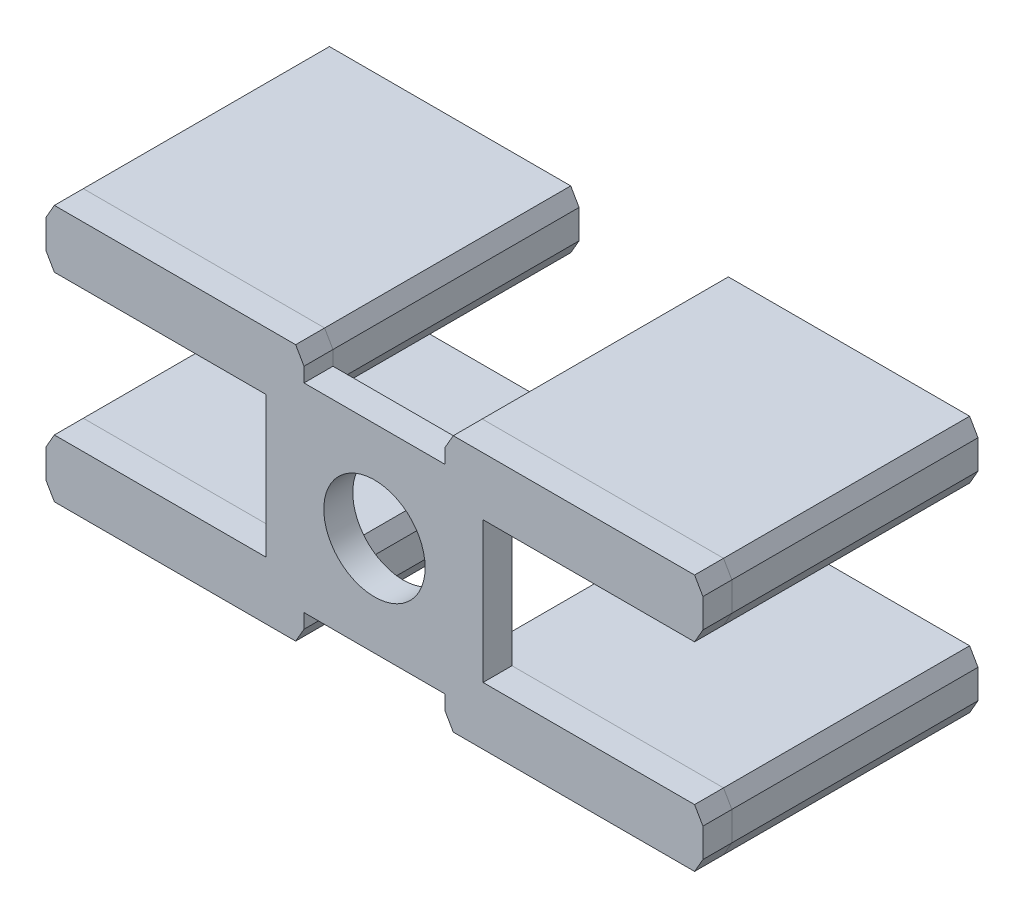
ISO-10303-21;
HEADER;
FILE_DESCRIPTION(('STEP AP214'),'2;1');
FILE_NAME('part.step','',(''),(''),'','','');
FILE_SCHEMA(('AUTOMOTIVE_DESIGN { 1 0 10303 214 1 1 1 1 }'));
ENDSEC;
DATA;
#1=APPLICATION_CONTEXT('core data for automotive mechanical design processes');
#2=APPLICATION_PROTOCOL_DEFINITION('international standard','automotive_design',2000,#1);
#3=PRODUCT_CONTEXT('',#1,'mechanical');
#4=PRODUCT('Part','Part','',(#3));
#5=PRODUCT_RELATED_PRODUCT_CATEGORY('part','',(#4));
#6=PRODUCT_DEFINITION_FORMATION('','',#4);
#7=PRODUCT_DEFINITION_CONTEXT('part definition',#1,'design');
#8=PRODUCT_DEFINITION('design','',#6,#7);
#9=PRODUCT_DEFINITION_SHAPE('','',#8);
#10=(LENGTH_UNIT() NAMED_UNIT(*) SI_UNIT(.MILLI.,.METRE.));
#11=(NAMED_UNIT(*) PLANE_ANGLE_UNIT() SI_UNIT($,.RADIAN.));
#12=(NAMED_UNIT(*) SI_UNIT($,.STERADIAN.) SOLID_ANGLE_UNIT());
#13=UNCERTAINTY_MEASURE_WITH_UNIT(LENGTH_MEASURE(1.E-05),#10,'distance_accuracy_value','');
#14=(GEOMETRIC_REPRESENTATION_CONTEXT(3) GLOBAL_UNCERTAINTY_ASSIGNED_CONTEXT((#13)) GLOBAL_UNIT_ASSIGNED_CONTEXT((#10,
#11,#12)) REPRESENTATION_CONTEXT('',''));
#15=CARTESIAN_POINT('',(0.,0.,0.));
#16=DIRECTION('',(0.,0.,1.));
#17=DIRECTION('',(1.,0.,0.));
#18=AXIS2_PLACEMENT_3D('',#15,#16,#17);
#19=CARTESIAN_POINT('',(0.,0.,57.));
#20=DIRECTION('',(0.,0.,1.));
#21=DIRECTION('',(1.,0.,0.));
#22=AXIS2_PLACEMENT_3D('',#19,#20,#21);
#23=PLANE('',#22);
#24=DIRECTION('',(-1.,0.,0.));
#25=VECTOR('',#24,1.);
#26=CARTESIAN_POINT('',(-16.3320508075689,26.6,57.));
#27=LINE('',#26,#25);
#28=CARTESIAN_POINT('',(-16.3320508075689,26.6,57.));
#29=VERTEX_POINT('',#28);
#30=CARTESIAN_POINT('',(-66.3320508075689,26.6,57.));
#31=VERTEX_POINT('',#30);
#32=EDGE_CURVE('E350',#29,#31,#27,.T.);
#33=ORIENTED_EDGE('',*,*,#32,.T.);
#34=DIRECTION('',(-0.499999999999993,-0.866025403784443,0.));
#35=VECTOR('',#34,1.);
#36=CARTESIAN_POINT('',(-66.3320508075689,26.6,57.));
#37=LINE('',#36,#35);
#38=CARTESIAN_POINT('',(-68.0641016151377,23.6,57.));
#39=VERTEX_POINT('',#38);
#40=EDGE_CURVE('E178',#31,#39,#37,.T.);
#41=ORIENTED_EDGE('',*,*,#40,.T.);
#42=DIRECTION('',(0.,-1.,0.));
#43=VECTOR('',#42,1.);
#44=CARTESIAN_POINT('',(-68.0641016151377,23.6,57.));
#45=LINE('',#44,#43);
#46=CARTESIAN_POINT('',(-68.0641016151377,17.6,57.));
#47=VERTEX_POINT('',#46);
#48=EDGE_CURVE('E437',#39,#47,#45,.T.);
#49=ORIENTED_EDGE('',*,*,#48,.T.);
#50=DIRECTION('',(0.499999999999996,-0.866025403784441,0.));
#51=VECTOR('',#50,1.);
#52=CARTESIAN_POINT('',(-68.0641016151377,17.6,57.));
#53=LINE('',#52,#51);
#54=CARTESIAN_POINT('',(-66.3320508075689,14.6,57.));
#55=VERTEX_POINT('',#54);
#56=EDGE_CURVE('E456',#47,#55,#53,.T.);
#57=ORIENTED_EDGE('',*,*,#56,.T.);
#58=DIRECTION('',(1.,0.,0.));
#59=VECTOR('',#58,1.);
#60=CARTESIAN_POINT('',(-66.3320508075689,14.6,57.));
#61=LINE('',#60,#59);
#62=CARTESIAN_POINT('',(-22.5,14.6,57.));
#63=VERTEX_POINT('',#62);
#64=EDGE_CURVE('E453',#55,#63,#61,.T.);
#65=ORIENTED_EDGE('',*,*,#64,.T.);
#66=DIRECTION('',(0.,-1.,0.));
#67=VECTOR('',#66,1.);
#68=CARTESIAN_POINT('',(-22.5,14.6,57.));
#69=LINE('',#68,#67);
#70=CARTESIAN_POINT('',(-22.5,-14.6000000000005,57.));
#71=VERTEX_POINT('',#70);
#72=EDGE_CURVE('E455',#63,#71,#69,.T.);
#73=ORIENTED_EDGE('',*,*,#72,.T.);
#74=DIRECTION('',(-1.,0.,0.));
#75=VECTOR('',#74,1.);
#76=CARTESIAN_POINT('',(-22.5,-14.6000000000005,57.));
#77=LINE('',#76,#75);
#78=CARTESIAN_POINT('',(-66.3320508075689,-14.6,57.));
#79=VERTEX_POINT('',#78);
#80=EDGE_CURVE('E458',#71,#79,#77,.T.);
#81=ORIENTED_EDGE('',*,*,#80,.T.);
#82=DIRECTION('',(-0.499999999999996,-0.866025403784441,0.));
#83=VECTOR('',#82,1.);
#84=CARTESIAN_POINT('',(-66.3320508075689,-14.6,57.));
#85=LINE('',#84,#83);
#86=CARTESIAN_POINT('',(-68.0641016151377,-17.6,57.));
#87=VERTEX_POINT('',#86);
#88=EDGE_CURVE('E464',#79,#87,#85,.T.);
#89=ORIENTED_EDGE('',*,*,#88,.T.);
#90=DIRECTION('',(0.,-1.,0.));
#91=VECTOR('',#90,1.);
#92=CARTESIAN_POINT('',(-68.0641016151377,-17.6,57.));
#93=LINE('',#92,#91);
#94=CARTESIAN_POINT('',(-68.0641016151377,-23.6,57.));
#95=VERTEX_POINT('',#94);
#96=EDGE_CURVE('E466',#87,#95,#93,.T.);
#97=ORIENTED_EDGE('',*,*,#96,.T.);
#98=DIRECTION('',(0.499999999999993,-0.866025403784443,0.));
#99=VECTOR('',#98,1.);
#100=CARTESIAN_POINT('',(-68.0641016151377,-23.6,57.));
#101=LINE('',#100,#99);
#102=CARTESIAN_POINT('',(-66.3320508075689,-26.6,57.));
#103=VERTEX_POINT('',#102);
#104=EDGE_CURVE('E468',#95,#103,#101,.T.);
#105=ORIENTED_EDGE('',*,*,#104,.T.);
#106=DIRECTION('',(1.,0.,0.));
#107=VECTOR('',#106,1.);
#108=CARTESIAN_POINT('',(-66.3320508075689,-26.6,57.));
#109=LINE('',#108,#107);
#110=CARTESIAN_POINT('',(-16.3320508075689,-26.6,57.));
#111=VERTEX_POINT('',#110);
#112=EDGE_CURVE('E470',#103,#111,#109,.T.);
#113=ORIENTED_EDGE('',*,*,#112,.T.);
#114=DIRECTION('',(0.499999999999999,0.866025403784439,0.));
#115=VECTOR('',#114,1.);
#116=CARTESIAN_POINT('',(-16.3320508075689,-26.6,57.));
#117=LINE('',#116,#115);
#118=CARTESIAN_POINT('',(-14.6,-23.6,57.));
#119=VERTEX_POINT('',#118);
#120=EDGE_CURVE('E472',#111,#119,#117,.T.);
#121=ORIENTED_EDGE('',*,*,#120,.T.);
#122=DIRECTION('',(0.,1.,0.));
#123=VECTOR('',#122,1.);
#124=CARTESIAN_POINT('',(-14.6,-23.6,57.));
#125=LINE('',#124,#123);
#126=CARTESIAN_POINT('',(-14.6,-20.6,57.));
#127=VERTEX_POINT('',#126);
#128=EDGE_CURVE('E474',#119,#127,#125,.T.);
#129=ORIENTED_EDGE('',*,*,#128,.T.);
#130=DIRECTION('',(1.,0.,0.));
#131=VECTOR('',#130,1.);
#132=CARTESIAN_POINT('',(-14.6,-20.6,57.));
#133=LINE('',#132,#131);
#134=CARTESIAN_POINT('',(14.5999999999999,-20.6000000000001,57.));
#135=VERTEX_POINT('',#134);
#136=EDGE_CURVE('E476',#127,#135,#133,.T.);
#137=ORIENTED_EDGE('',*,*,#136,.T.);
#138=DIRECTION('',(0.,-1.,0.));
#139=VECTOR('',#138,1.);
#140=CARTESIAN_POINT('',(14.5999999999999,-20.6000000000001,57.));
#141=LINE('',#140,#139);
#142=CARTESIAN_POINT('',(14.5999999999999,-23.6000000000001,57.));
#143=VERTEX_POINT('',#142);
#144=EDGE_CURVE('E478',#135,#143,#141,.T.);
#145=ORIENTED_EDGE('',*,*,#144,.T.);
#146=DIRECTION('',(0.499999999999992,-0.866025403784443,0.));
#147=VECTOR('',#146,1.);
#148=CARTESIAN_POINT('',(14.5999999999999,-23.6000000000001,57.));
#149=LINE('',#148,#147);
#150=CARTESIAN_POINT('',(16.3320508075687,-26.6000000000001,57.));
#151=VERTEX_POINT('',#150);
#152=EDGE_CURVE('E480',#143,#151,#149,.T.);
#153=ORIENTED_EDGE('',*,*,#152,.T.);
#154=DIRECTION('',(1.,0.,0.));
#155=VECTOR('',#154,1.);
#156=CARTESIAN_POINT('',(16.3320508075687,-26.6000000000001,57.));
#157=LINE('',#156,#155);
#158=CARTESIAN_POINT('',(66.3320508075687,-26.6000000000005,57.));
#159=VERTEX_POINT('',#158);
#160=EDGE_CURVE('E482',#151,#159,#157,.T.);
#161=ORIENTED_EDGE('',*,*,#160,.T.);
#162=DIRECTION('',(0.5,0.866025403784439,0.));
#163=VECTOR('',#162,1.);
#164=CARTESIAN_POINT('',(66.3320508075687,-26.6000000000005,57.));
#165=LINE('',#164,#163);
#166=CARTESIAN_POINT('',(68.0641016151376,-23.6000000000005,57.));
#167=VERTEX_POINT('',#166);
#168=EDGE_CURVE('E484',#159,#167,#165,.T.);
#169=ORIENTED_EDGE('',*,*,#168,.T.);
#170=DIRECTION('',(0.,1.,0.));
#171=VECTOR('',#170,1.);
#172=CARTESIAN_POINT('',(68.0641016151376,-23.6000000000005,57.));
#173=LINE('',#172,#171);
#174=CARTESIAN_POINT('',(68.0641016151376,-17.6000000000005,57.));
#175=VERTEX_POINT('',#174);
#176=EDGE_CURVE('E486',#167,#175,#173,.T.);
#177=ORIENTED_EDGE('',*,*,#176,.T.);
#178=DIRECTION('',(-0.499999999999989,0.866025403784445,0.));
#179=VECTOR('',#178,1.);
#180=CARTESIAN_POINT('',(68.0641016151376,-17.6000000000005,57.));
#181=LINE('',#180,#179);
#182=CARTESIAN_POINT('',(66.3320508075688,-14.6000000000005,57.));
#183=VERTEX_POINT('',#182);
#184=EDGE_CURVE('E488',#175,#183,#181,.T.);
#185=ORIENTED_EDGE('',*,*,#184,.T.);
#186=DIRECTION('',(-1.,0.,0.));
#187=VECTOR('',#186,1.);
#188=CARTESIAN_POINT('',(66.3320508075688,-14.6000000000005,57.));
#189=LINE('',#188,#187);
#190=CARTESIAN_POINT('',(22.5,-14.6000000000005,57.));
#191=VERTEX_POINT('',#190);
#192=EDGE_CURVE('E490',#183,#191,#189,.T.);
#193=ORIENTED_EDGE('',*,*,#192,.T.);
#194=DIRECTION('',(0.,1.,0.));
#195=VECTOR('',#194,1.);
#196=CARTESIAN_POINT('',(22.5,14.6,57.));
#197=LINE('',#196,#195);
#198=CARTESIAN_POINT('',(22.5,14.6,57.));
#199=VERTEX_POINT('',#198);
#200=EDGE_CURVE('E492',#191,#199,#197,.T.);
#201=ORIENTED_EDGE('',*,*,#200,.T.);
#202=DIRECTION('',(1.,0.,0.));
#203=VECTOR('',#202,1.);
#204=CARTESIAN_POINT('',(22.5,14.6,57.));
#205=LINE('',#204,#203);
#206=CARTESIAN_POINT('',(66.3320508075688,14.6000000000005,57.));
#207=VERTEX_POINT('',#206);
#208=EDGE_CURVE('E494',#199,#207,#205,.T.);
#209=ORIENTED_EDGE('',*,*,#208,.T.);
#210=DIRECTION('',(0.499999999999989,0.866025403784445,0.));
#211=VECTOR('',#210,1.);
#212=CARTESIAN_POINT('',(66.3320508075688,14.6000000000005,57.));
#213=LINE('',#212,#211);
#214=CARTESIAN_POINT('',(68.0641016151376,17.6000000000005,57.));
#215=VERTEX_POINT('',#214);
#216=EDGE_CURVE('E496',#207,#215,#213,.T.);
#217=ORIENTED_EDGE('',*,*,#216,.T.);
#218=DIRECTION('',(0.,1.,0.));
#219=VECTOR('',#218,1.);
#220=CARTESIAN_POINT('',(68.0641016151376,17.6000000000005,57.));
#221=LINE('',#220,#219);
#222=CARTESIAN_POINT('',(68.0641016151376,23.6000000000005,57.));
#223=VERTEX_POINT('',#222);
#224=EDGE_CURVE('E498',#215,#223,#221,.T.);
#225=ORIENTED_EDGE('',*,*,#224,.T.);
#226=DIRECTION('',(-0.5,0.866025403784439,0.));
#227=VECTOR('',#226,1.);
#228=CARTESIAN_POINT('',(68.0641016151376,23.6000000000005,57.));
#229=LINE('',#228,#227);
#230=CARTESIAN_POINT('',(66.3320508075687,26.6000000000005,57.));
#231=VERTEX_POINT('',#230);
#232=EDGE_CURVE('E500',#223,#231,#229,.T.);
#233=ORIENTED_EDGE('',*,*,#232,.T.);
#234=DIRECTION('',(-1.,0.,0.));
#235=VECTOR('',#234,1.);
#236=CARTESIAN_POINT('',(66.3320508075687,26.6000000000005,57.));
#237=LINE('',#236,#235);
#238=CARTESIAN_POINT('',(16.3320508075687,26.6000000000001,57.));
#239=VERTEX_POINT('',#238);
#240=EDGE_CURVE('E502',#231,#239,#237,.T.);
#241=ORIENTED_EDGE('',*,*,#240,.T.);
#242=DIRECTION('',(-0.499999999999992,-0.866025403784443,0.));
#243=VECTOR('',#242,1.);
#244=CARTESIAN_POINT('',(16.3320508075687,26.6000000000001,57.));
#245=LINE('',#244,#243);
#246=CARTESIAN_POINT('',(14.5999999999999,23.6000000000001,57.));
#247=VERTEX_POINT('',#246);
#248=EDGE_CURVE('E504',#239,#247,#245,.T.);
#249=ORIENTED_EDGE('',*,*,#248,.T.);
#250=DIRECTION('',(0.,-1.,0.));
#251=VECTOR('',#250,1.);
#252=CARTESIAN_POINT('',(14.5999999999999,23.6000000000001,57.));
#253=LINE('',#252,#251);
#254=CARTESIAN_POINT('',(14.5999999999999,20.6000000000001,57.));
#255=VERTEX_POINT('',#254);
#256=EDGE_CURVE('E269',#247,#255,#253,.T.);
#257=ORIENTED_EDGE('',*,*,#256,.T.);
#258=DIRECTION('',(-1.,0.,0.));
#259=VECTOR('',#258,1.);
#260=CARTESIAN_POINT('',(-14.6,20.6,57.));
#261=LINE('',#260,#259);
#262=CARTESIAN_POINT('',(-14.6,20.6,57.));
#263=VERTEX_POINT('',#262);
#264=EDGE_CURVE('E263',#255,#263,#261,.T.);
#265=ORIENTED_EDGE('',*,*,#264,.T.);
#266=DIRECTION('',(0.,1.,0.));
#267=VECTOR('',#266,1.);
#268=CARTESIAN_POINT('',(-14.6,20.6,57.));
#269=LINE('',#268,#267);
#270=CARTESIAN_POINT('',(-14.6,23.6,57.));
#271=VERTEX_POINT('',#270);
#272=EDGE_CURVE('E267',#263,#271,#269,.T.);
#273=ORIENTED_EDGE('',*,*,#272,.T.);
#274=DIRECTION('',(-0.499999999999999,0.866025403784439,0.));
#275=VECTOR('',#274,1.);
#276=CARTESIAN_POINT('',(-14.6,23.6,57.));
#277=LINE('',#276,#275);
#278=EDGE_CURVE('E63',#271,#29,#277,.T.);
#279=ORIENTED_EDGE('',*,*,#278,.T.);
#280=EDGE_LOOP('',(#33,#41,#49,#57,#65,#73,#81,#89,#97,#105,#113,#121,#129,#137,#145,#153,#161,
#169,#177,#185,#193,#201,#209,#217,#225,#233,#241,#249,#257,#265,#273,#279));
#281=FACE_BOUND('',#280,.T.);
#282=CARTESIAN_POINT('',(0.,0.,57.));
#283=DIRECTION('',(0.,0.,1.));
#284=DIRECTION('',(1.,0.,0.));
#285=AXIS2_PLACEMENT_3D('',#282,#283,#284);
#286=CIRCLE('',#285,10.5);
#287=CARTESIAN_POINT('',(10.5,0.,57.));
#288=VERTEX_POINT('',#287);
#289=EDGE_CURVE('E291',#288,#288,#286,.T.);
#290=ORIENTED_EDGE('',*,*,#289,.F.);
#291=EDGE_LOOP('',(#290));
#292=FACE_BOUND('',#291,.T.);
#293=ADVANCED_FACE('F46',(#281,#292),#23,.T.);
#294=CARTESIAN_POINT('',(0.,0.,51.));
#295=DIRECTION('',(0.,0.,1.));
#296=DIRECTION('',(1.,0.,0.));
#297=AXIS2_PLACEMENT_3D('',#294,#295,#296);
#298=PLANE('',#297);
#299=DIRECTION('',(-1.,0.,0.));
#300=VECTOR('',#299,1.);
#301=CARTESIAN_POINT('',(-16.3320508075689,26.6,51.));
#302=LINE('',#301,#300);
#303=CARTESIAN_POINT('',(-16.3320508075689,26.6,51.));
#304=VERTEX_POINT('',#303);
#305=CARTESIAN_POINT('',(-66.3320508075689,26.6,51.));
#306=VERTEX_POINT('',#305);
#307=EDGE_CURVE('E287',#304,#306,#302,.T.);
#308=ORIENTED_EDGE('',*,*,#307,.F.);
#309=DIRECTION('',(-0.499999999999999,0.866025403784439,0.));
#310=VECTOR('',#309,1.);
#311=CARTESIAN_POINT('',(-14.6,23.6,51.));
#312=LINE('',#311,#310);
#313=CARTESIAN_POINT('',(-14.6,23.6,51.));
#314=VERTEX_POINT('',#313);
#315=EDGE_CURVE('E170',#314,#304,#312,.T.);
#316=ORIENTED_EDGE('',*,*,#315,.F.);
#317=DIRECTION('',(0.,1.,0.));
#318=VECTOR('',#317,1.);
#319=CARTESIAN_POINT('',(-14.6,20.6,51.));
#320=LINE('',#319,#318);
#321=CARTESIAN_POINT('',(-14.6,20.6,51.));
#322=VERTEX_POINT('',#321);
#323=EDGE_CURVE('E164',#322,#314,#320,.T.);
#324=ORIENTED_EDGE('',*,*,#323,.F.);
#325=DIRECTION('',(-1.,0.,0.));
#326=VECTOR('',#325,1.);
#327=CARTESIAN_POINT('',(-14.6,20.6,51.));
#328=LINE('',#327,#326);
#329=CARTESIAN_POINT('',(14.5999999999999,20.6000000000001,51.));
#330=VERTEX_POINT('',#329);
#331=EDGE_CURVE('E277',#330,#322,#328,.T.);
#332=ORIENTED_EDGE('',*,*,#331,.F.);
#333=DIRECTION('',(0.,-1.,0.));
#334=VECTOR('',#333,1.);
#335=CARTESIAN_POINT('',(14.5999999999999,23.6000000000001,51.));
#336=LINE('',#335,#334);
#337=CARTESIAN_POINT('',(14.5999999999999,23.6000000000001,51.));
#338=VERTEX_POINT('',#337);
#339=EDGE_CURVE('E345',#338,#330,#336,.T.);
#340=ORIENTED_EDGE('',*,*,#339,.F.);
#341=DIRECTION('',(-0.499999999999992,-0.866025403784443,0.));
#342=VECTOR('',#341,1.);
#343=CARTESIAN_POINT('',(16.3320508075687,26.6000000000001,51.));
#344=LINE('',#343,#342);
#345=CARTESIAN_POINT('',(16.3320508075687,26.6000000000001,51.));
#346=VERTEX_POINT('',#345);
#347=EDGE_CURVE('E343',#346,#338,#344,.T.);
#348=ORIENTED_EDGE('',*,*,#347,.F.);
#349=DIRECTION('',(-1.,0.,0.));
#350=VECTOR('',#349,1.);
#351=CARTESIAN_POINT('',(66.3320508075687,26.6000000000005,51.));
#352=LINE('',#351,#350);
#353=CARTESIAN_POINT('',(66.3320508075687,26.6000000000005,51.));
#354=VERTEX_POINT('',#353);
#355=EDGE_CURVE('E341',#354,#346,#352,.T.);
#356=ORIENTED_EDGE('',*,*,#355,.F.);
#357=DIRECTION('',(-0.5,0.866025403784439,0.));
#358=VECTOR('',#357,1.);
#359=CARTESIAN_POINT('',(68.0641016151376,23.6000000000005,51.));
#360=LINE('',#359,#358);
#361=CARTESIAN_POINT('',(68.0641016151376,23.6000000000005,51.));
#362=VERTEX_POINT('',#361);
#363=EDGE_CURVE('E339',#362,#354,#360,.T.);
#364=ORIENTED_EDGE('',*,*,#363,.F.);
#365=DIRECTION('',(0.,1.,0.));
#366=VECTOR('',#365,1.);
#367=CARTESIAN_POINT('',(68.0641016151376,17.6000000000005,51.));
#368=LINE('',#367,#366);
#369=CARTESIAN_POINT('',(68.0641016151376,17.6000000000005,51.));
#370=VERTEX_POINT('',#369);
#371=EDGE_CURVE('E337',#370,#362,#368,.T.);
#372=ORIENTED_EDGE('',*,*,#371,.F.);
#373=DIRECTION('',(0.499999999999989,0.866025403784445,0.));
#374=VECTOR('',#373,1.);
#375=CARTESIAN_POINT('',(66.3320508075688,14.6000000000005,51.));
#376=LINE('',#375,#374);
#377=CARTESIAN_POINT('',(66.3320508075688,14.6000000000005,51.));
#378=VERTEX_POINT('',#377);
#379=EDGE_CURVE('E335',#378,#370,#376,.T.);
#380=ORIENTED_EDGE('',*,*,#379,.F.);
#381=DIRECTION('',(1.,0.,0.));
#382=VECTOR('',#381,1.);
#383=CARTESIAN_POINT('',(22.5,14.6,51.));
#384=LINE('',#383,#382);
#385=CARTESIAN_POINT('',(22.5,14.6,51.));
#386=VERTEX_POINT('',#385);
#387=EDGE_CURVE('E333',#386,#378,#384,.T.);
#388=ORIENTED_EDGE('',*,*,#387,.F.);
#389=DIRECTION('',(0.,1.,0.));
#390=VECTOR('',#389,1.);
#391=CARTESIAN_POINT('',(22.5,14.6,51.));
#392=LINE('',#391,#390);
#393=CARTESIAN_POINT('',(22.5,-14.6000000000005,51.));
#394=VERTEX_POINT('',#393);
#395=EDGE_CURVE('E331',#394,#386,#392,.T.);
#396=ORIENTED_EDGE('',*,*,#395,.F.);
#397=DIRECTION('',(-1.,0.,0.));
#398=VECTOR('',#397,1.);
#399=CARTESIAN_POINT('',(66.3320508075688,-14.6000000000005,51.));
#400=LINE('',#399,#398);
#401=CARTESIAN_POINT('',(66.3320508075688,-14.6000000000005,51.));
#402=VERTEX_POINT('',#401);
#403=EDGE_CURVE('E329',#402,#394,#400,.T.);
#404=ORIENTED_EDGE('',*,*,#403,.F.);
#405=DIRECTION('',(-0.499999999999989,0.866025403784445,0.));
#406=VECTOR('',#405,1.);
#407=CARTESIAN_POINT('',(68.0641016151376,-17.6000000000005,51.));
#408=LINE('',#407,#406);
#409=CARTESIAN_POINT('',(68.0641016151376,-17.6000000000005,51.));
#410=VERTEX_POINT('',#409);
#411=EDGE_CURVE('E327',#410,#402,#408,.T.);
#412=ORIENTED_EDGE('',*,*,#411,.F.);
#413=DIRECTION('',(0.,1.,0.));
#414=VECTOR('',#413,1.);
#415=CARTESIAN_POINT('',(68.0641016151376,-23.6000000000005,51.));
#416=LINE('',#415,#414);
#417=CARTESIAN_POINT('',(68.0641016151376,-23.6000000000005,51.));
#418=VERTEX_POINT('',#417);
#419=EDGE_CURVE('E325',#418,#410,#416,.T.);
#420=ORIENTED_EDGE('',*,*,#419,.F.);
#421=DIRECTION('',(0.5,0.866025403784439,0.));
#422=VECTOR('',#421,1.);
#423=CARTESIAN_POINT('',(66.3320508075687,-26.6000000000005,51.));
#424=LINE('',#423,#422);
#425=CARTESIAN_POINT('',(66.3320508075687,-26.6000000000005,51.));
#426=VERTEX_POINT('',#425);
#427=EDGE_CURVE('E323',#426,#418,#424,.T.);
#428=ORIENTED_EDGE('',*,*,#427,.F.);
#429=DIRECTION('',(1.,0.,0.));
#430=VECTOR('',#429,1.);
#431=CARTESIAN_POINT('',(16.3320508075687,-26.6000000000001,51.));
#432=LINE('',#431,#430);
#433=CARTESIAN_POINT('',(16.3320508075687,-26.6000000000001,51.));
#434=VERTEX_POINT('',#433);
#435=EDGE_CURVE('E321',#434,#426,#432,.T.);
#436=ORIENTED_EDGE('',*,*,#435,.F.);
#437=DIRECTION('',(0.499999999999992,-0.866025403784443,0.));
#438=VECTOR('',#437,1.);
#439=CARTESIAN_POINT('',(14.5999999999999,-23.6000000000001,51.));
#440=LINE('',#439,#438);
#441=CARTESIAN_POINT('',(14.5999999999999,-23.6000000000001,51.));
#442=VERTEX_POINT('',#441);
#443=EDGE_CURVE('E319',#442,#434,#440,.T.);
#444=ORIENTED_EDGE('',*,*,#443,.F.);
#445=DIRECTION('',(0.,-1.,0.));
#446=VECTOR('',#445,1.);
#447=CARTESIAN_POINT('',(14.5999999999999,-20.6000000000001,51.));
#448=LINE('',#447,#446);
#449=CARTESIAN_POINT('',(14.5999999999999,-20.6000000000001,51.));
#450=VERTEX_POINT('',#449);
#451=EDGE_CURVE('E317',#450,#442,#448,.T.);
#452=ORIENTED_EDGE('',*,*,#451,.F.);
#453=DIRECTION('',(1.,0.,0.));
#454=VECTOR('',#453,1.);
#455=CARTESIAN_POINT('',(-14.6,-20.6,51.));
#456=LINE('',#455,#454);
#457=CARTESIAN_POINT('',(-14.6,-20.6,51.));
#458=VERTEX_POINT('',#457);
#459=EDGE_CURVE('E315',#458,#450,#456,.T.);
#460=ORIENTED_EDGE('',*,*,#459,.F.);
#461=DIRECTION('',(0.,1.,0.));
#462=VECTOR('',#461,1.);
#463=CARTESIAN_POINT('',(-14.6,-23.6,51.));
#464=LINE('',#463,#462);
#465=CARTESIAN_POINT('',(-14.6,-23.6,51.));
#466=VERTEX_POINT('',#465);
#467=EDGE_CURVE('E313',#466,#458,#464,.T.);
#468=ORIENTED_EDGE('',*,*,#467,.F.);
#469=DIRECTION('',(0.499999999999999,0.866025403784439,0.));
#470=VECTOR('',#469,1.);
#471=CARTESIAN_POINT('',(-16.3320508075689,-26.6,51.));
#472=LINE('',#471,#470);
#473=CARTESIAN_POINT('',(-16.3320508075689,-26.6,51.));
#474=VERTEX_POINT('',#473);
#475=EDGE_CURVE('E311',#474,#466,#472,.T.);
#476=ORIENTED_EDGE('',*,*,#475,.F.);
#477=DIRECTION('',(1.,0.,0.));
#478=VECTOR('',#477,1.);
#479=CARTESIAN_POINT('',(-66.3320508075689,-26.6,51.));
#480=LINE('',#479,#478);
#481=CARTESIAN_POINT('',(-66.3320508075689,-26.6,51.));
#482=VERTEX_POINT('',#481);
#483=EDGE_CURVE('E309',#482,#474,#480,.T.);
#484=ORIENTED_EDGE('',*,*,#483,.F.);
#485=DIRECTION('',(0.499999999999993,-0.866025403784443,0.));
#486=VECTOR('',#485,1.);
#487=CARTESIAN_POINT('',(-68.0641016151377,-23.6,51.));
#488=LINE('',#487,#486);
#489=CARTESIAN_POINT('',(-68.0641016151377,-23.6,51.));
#490=VERTEX_POINT('',#489);
#491=EDGE_CURVE('E307',#490,#482,#488,.T.);
#492=ORIENTED_EDGE('',*,*,#491,.F.);
#493=DIRECTION('',(0.,-1.,0.));
#494=VECTOR('',#493,1.);
#495=CARTESIAN_POINT('',(-68.0641016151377,-17.6,51.));
#496=LINE('',#495,#494);
#497=CARTESIAN_POINT('',(-68.0641016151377,-17.6,51.));
#498=VERTEX_POINT('',#497);
#499=EDGE_CURVE('E305',#498,#490,#496,.T.);
#500=ORIENTED_EDGE('',*,*,#499,.F.);
#501=DIRECTION('',(-0.499999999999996,-0.866025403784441,0.));
#502=VECTOR('',#501,1.);
#503=CARTESIAN_POINT('',(-66.3320508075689,-14.6,51.));
#504=LINE('',#503,#502);
#505=CARTESIAN_POINT('',(-66.3320508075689,-14.6,51.));
#506=VERTEX_POINT('',#505);
#507=EDGE_CURVE('E303',#506,#498,#504,.T.);
#508=ORIENTED_EDGE('',*,*,#507,.F.);
#509=DIRECTION('',(-1.,0.,0.));
#510=VECTOR('',#509,1.);
#511=CARTESIAN_POINT('',(-22.5,-14.6000000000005,51.));
#512=LINE('',#511,#510);
#513=CARTESIAN_POINT('',(-22.5,-14.6000000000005,51.));
#514=VERTEX_POINT('',#513);
#515=EDGE_CURVE('E301',#514,#506,#512,.T.);
#516=ORIENTED_EDGE('',*,*,#515,.F.);
#517=DIRECTION('',(0.,-1.,0.));
#518=VECTOR('',#517,1.);
#519=CARTESIAN_POINT('',(-22.5,14.6,51.));
#520=LINE('',#519,#518);
#521=CARTESIAN_POINT('',(-22.5,14.6,51.));
#522=VERTEX_POINT('',#521);
#523=EDGE_CURVE('E299',#522,#514,#520,.T.);
#524=ORIENTED_EDGE('',*,*,#523,.F.);
#525=DIRECTION('',(1.,0.,0.));
#526=VECTOR('',#525,1.);
#527=CARTESIAN_POINT('',(-66.3320508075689,14.6,51.));
#528=LINE('',#527,#526);
#529=CARTESIAN_POINT('',(-66.3320508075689,14.6,51.));
#530=VERTEX_POINT('',#529);
#531=EDGE_CURVE('E297',#530,#522,#528,.T.);
#532=ORIENTED_EDGE('',*,*,#531,.F.);
#533=DIRECTION('',(0.499999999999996,-0.866025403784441,0.));
#534=VECTOR('',#533,1.);
#535=CARTESIAN_POINT('',(-68.0641016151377,17.6,51.));
#536=LINE('',#535,#534);
#537=CARTESIAN_POINT('',(-68.0641016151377,17.6,51.));
#538=VERTEX_POINT('',#537);
#539=EDGE_CURVE('E295',#538,#530,#536,.T.);
#540=ORIENTED_EDGE('',*,*,#539,.F.);
#541=DIRECTION('',(0.,-1.,0.));
#542=VECTOR('',#541,1.);
#543=CARTESIAN_POINT('',(-68.0641016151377,23.6,51.));
#544=LINE('',#543,#542);
#545=CARTESIAN_POINT('',(-68.0641016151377,23.6,51.));
#546=VERTEX_POINT('',#545);
#547=EDGE_CURVE('E293',#546,#538,#544,.T.);
#548=ORIENTED_EDGE('',*,*,#547,.F.);
#549=DIRECTION('',(-0.499999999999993,-0.866025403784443,0.));
#550=VECTOR('',#549,1.);
#551=CARTESIAN_POINT('',(-66.3320508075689,26.6,51.));
#552=LINE('',#551,#550);
#553=EDGE_CURVE('E290',#306,#546,#552,.T.);
#554=ORIENTED_EDGE('',*,*,#553,.F.);
#555=EDGE_LOOP('',(#308,#316,#324,#332,#340,#348,#356,#364,#372,#380,#388,#396,#404,#412,#420,
#428,#436,#444,#452,#460,#468,#476,#484,#492,#500,#508,#516,#524,#532,#540,#548,#554));
#556=FACE_BOUND('',#555,.T.);
#557=CARTESIAN_POINT('',(0.,0.,51.));
#558=DIRECTION('',(0.,0.,1.));
#559=DIRECTION('',(1.,0.,0.));
#560=AXIS2_PLACEMENT_3D('',#557,#558,#559);
#561=CIRCLE('',#560,10.5);
#562=CARTESIAN_POINT('',(10.5,0.,51.));
#563=VERTEX_POINT('',#562);
#564=EDGE_CURVE('E911',#563,#563,#561,.T.);
#565=ORIENTED_EDGE('',*,*,#564,.T.);
#566=EDGE_LOOP('',(#565));
#567=FACE_BOUND('',#566,.T.);
#568=ADVANCED_FACE('F441',(#556,#567),#298,.F.);
#569=CARTESIAN_POINT('',(-16.3320508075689,26.6,57.));
#570=DIRECTION('',(0.,-1.,0.));
#571=DIRECTION('',(1.,0.,0.));
#572=AXIS2_PLACEMENT_3D('',#569,#570,#571);
#573=PLANE('',#572);
#574=ORIENTED_EDGE('',*,*,#307,.T.);
#575=DIRECTION('',(0.,0.,-1.));
#576=VECTOR('',#575,1.);
#577=CARTESIAN_POINT('',(-66.3320508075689,26.6,57.));
#578=LINE('',#577,#576);
#579=EDGE_CURVE('E12',#31,#306,#578,.T.);
#580=ORIENTED_EDGE('',*,*,#579,.F.);
#581=ORIENTED_EDGE('',*,*,#32,.F.);
#582=DIRECTION('',(0.,0.,-1.));
#583=VECTOR('',#582,1.);
#584=CARTESIAN_POINT('',(-16.3320508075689,26.6,57.));
#585=LINE('',#584,#583);
#586=EDGE_CURVE('E283',#29,#304,#585,.T.);
#587=ORIENTED_EDGE('',*,*,#586,.T.);
#588=EDGE_LOOP('',(#574,#580,#581,#587));
#589=FACE_BOUND('',#588,.T.);
#590=ADVANCED_FACE('F48',(#589),#573,.F.);
#591=CARTESIAN_POINT('',(-66.3320508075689,26.6,57.));
#592=DIRECTION('',(0.866025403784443,-0.499999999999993,0.));
#593=DIRECTION('',(0.499999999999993,0.866025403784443,0.));
#594=AXIS2_PLACEMENT_3D('',#591,#592,#593);
#595=PLANE('',#594);
#596=ORIENTED_EDGE('',*,*,#553,.T.);
#597=DIRECTION('',(0.,0.,-1.));
#598=VECTOR('',#597,1.);
#599=CARTESIAN_POINT('',(-68.0641016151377,23.6,57.));
#600=LINE('',#599,#598);
#601=EDGE_CURVE('E55',#39,#546,#600,.T.);
#602=ORIENTED_EDGE('',*,*,#601,.F.);
#603=ORIENTED_EDGE('',*,*,#40,.F.);
#604=ORIENTED_EDGE('',*,*,#579,.T.);
#605=EDGE_LOOP('',(#596,#602,#603,#604));
#606=FACE_BOUND('',#605,.T.);
#607=ADVANCED_FACE('F538',(#606),#595,.F.);
#608=CARTESIAN_POINT('',(-68.0641016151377,23.6,57.));
#609=DIRECTION('',(1.,0.,0.));
#610=DIRECTION('',(0.,0.,-1.));
#611=AXIS2_PLACEMENT_3D('',#608,#609,#610);
#612=PLANE('',#611);
#613=ORIENTED_EDGE('',*,*,#547,.T.);
#614=DIRECTION('',(0.,0.,-1.));
#615=VECTOR('',#614,1.);
#616=CARTESIAN_POINT('',(-68.0641016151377,17.6,57.));
#617=LINE('',#616,#615);
#618=EDGE_CURVE('E429',#47,#538,#617,.T.);
#619=ORIENTED_EDGE('',*,*,#618,.F.);
#620=ORIENTED_EDGE('',*,*,#48,.F.);
#621=ORIENTED_EDGE('',*,*,#601,.T.);
#622=EDGE_LOOP('',(#613,#619,#620,#621));
#623=FACE_BOUND('',#622,.T.);
#624=ADVANCED_FACE('F435',(#623),#612,.F.);
#625=CARTESIAN_POINT('',(-68.0641016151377,17.6,57.));
#626=DIRECTION('',(0.866025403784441,0.499999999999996,0.));
#627=DIRECTION('',(-0.499999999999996,0.866025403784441,0.));
#628=AXIS2_PLACEMENT_3D('',#625,#626,#627);
#629=PLANE('',#628);
#630=ORIENTED_EDGE('',*,*,#539,.T.);
#631=DIRECTION('',(0.,0.,-1.));
#632=VECTOR('',#631,1.);
#633=CARTESIAN_POINT('',(-66.3320508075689,14.6,57.));
#634=LINE('',#633,#632);
#635=EDGE_CURVE('E426',#55,#530,#634,.T.);
#636=ORIENTED_EDGE('',*,*,#635,.F.);
#637=ORIENTED_EDGE('',*,*,#56,.F.);
#638=ORIENTED_EDGE('',*,*,#618,.T.);
#639=EDGE_LOOP('',(#630,#636,#637,#638));
#640=FACE_BOUND('',#639,.T.);
#641=ADVANCED_FACE('F447',(#640),#629,.F.);
#642=CARTESIAN_POINT('',(-66.3320508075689,14.6,57.));
#643=DIRECTION('',(0.,1.,0.));
#644=DIRECTION('',(-1.,0.,0.));
#645=AXIS2_PLACEMENT_3D('',#642,#643,#644);
#646=PLANE('',#645);
#647=ORIENTED_EDGE('',*,*,#531,.T.);
#648=DIRECTION('',(0.,0.,-1.));
#649=VECTOR('',#648,1.);
#650=CARTESIAN_POINT('',(-22.5,14.6,57.));
#651=LINE('',#650,#649);
#652=EDGE_CURVE('E423',#63,#522,#651,.T.);
#653=ORIENTED_EDGE('',*,*,#652,.F.);
#654=ORIENTED_EDGE('',*,*,#64,.F.);
#655=ORIENTED_EDGE('',*,*,#635,.T.);
#656=EDGE_LOOP('',(#647,#653,#654,#655));
#657=FACE_BOUND('',#656,.T.);
#658=ADVANCED_FACE('F451',(#657),#646,.F.);
#659=CARTESIAN_POINT('',(-22.5,14.6,57.));
#660=DIRECTION('',(1.,0.,0.));
#661=DIRECTION('',(0.,1.,0.));
#662=AXIS2_PLACEMENT_3D('',#659,#660,#661);
#663=PLANE('',#662);
#664=ORIENTED_EDGE('',*,*,#523,.T.);
#665=DIRECTION('',(0.,0.,-1.));
#666=VECTOR('',#665,1.);
#667=CARTESIAN_POINT('',(-22.5,-14.6000000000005,57.));
#668=LINE('',#667,#666);
#669=EDGE_CURVE('E420',#71,#514,#668,.T.);
#670=ORIENTED_EDGE('',*,*,#669,.F.);
#671=ORIENTED_EDGE('',*,*,#72,.F.);
#672=ORIENTED_EDGE('',*,*,#652,.T.);
#673=EDGE_LOOP('',(#664,#670,#671,#672));
#674=FACE_BOUND('',#673,.T.);
#675=ADVANCED_FACE('F551',(#674),#663,.F.);
#676=CARTESIAN_POINT('',(-22.5,-14.6000000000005,57.));
#677=DIRECTION('',(0.,-1.,0.));
#678=DIRECTION('',(1.,0.,0.));
#679=AXIS2_PLACEMENT_3D('',#676,#677,#678);
#680=PLANE('',#679);
#681=ORIENTED_EDGE('',*,*,#515,.T.);
#682=DIRECTION('',(0.,0.,-1.));
#683=VECTOR('',#682,1.);
#684=CARTESIAN_POINT('',(-66.3320508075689,-14.6,57.));
#685=LINE('',#684,#683);
#686=EDGE_CURVE('E417',#79,#506,#685,.T.);
#687=ORIENTED_EDGE('',*,*,#686,.F.);
#688=ORIENTED_EDGE('',*,*,#80,.F.);
#689=ORIENTED_EDGE('',*,*,#669,.T.);
#690=EDGE_LOOP('',(#681,#687,#688,#689));
#691=FACE_BOUND('',#690,.T.);
#692=ADVANCED_FACE('F554',(#691),#680,.F.);
#693=CARTESIAN_POINT('',(-66.3320508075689,-14.6,57.));
#694=DIRECTION('',(0.866025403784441,-0.499999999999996,0.));
#695=DIRECTION('',(0.499999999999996,0.866025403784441,0.));
#696=AXIS2_PLACEMENT_3D('',#693,#694,#695);
#697=PLANE('',#696);
#698=ORIENTED_EDGE('',*,*,#507,.T.);
#699=DIRECTION('',(0.,0.,-1.));
#700=VECTOR('',#699,1.);
#701=CARTESIAN_POINT('',(-68.0641016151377,-17.6,57.));
#702=LINE('',#701,#700);
#703=EDGE_CURVE('E414',#87,#498,#702,.T.);
#704=ORIENTED_EDGE('',*,*,#703,.F.);
#705=ORIENTED_EDGE('',*,*,#88,.F.);
#706=ORIENTED_EDGE('',*,*,#686,.T.);
#707=EDGE_LOOP('',(#698,#704,#705,#706));
#708=FACE_BOUND('',#707,.T.);
#709=ADVANCED_FACE('F558',(#708),#697,.F.);
#710=CARTESIAN_POINT('',(-68.0641016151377,-17.6,57.));
#711=DIRECTION('',(1.,0.,0.));
#712=DIRECTION('',(0.,0.,-1.));
#713=AXIS2_PLACEMENT_3D('',#710,#711,#712);
#714=PLANE('',#713);
#715=ORIENTED_EDGE('',*,*,#499,.T.);
#716=DIRECTION('',(0.,0.,-1.));
#717=VECTOR('',#716,1.);
#718=CARTESIAN_POINT('',(-68.0641016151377,-23.6,57.));
#719=LINE('',#718,#717);
#720=EDGE_CURVE('E411',#95,#490,#719,.T.);
#721=ORIENTED_EDGE('',*,*,#720,.F.);
#722=ORIENTED_EDGE('',*,*,#96,.F.);
#723=ORIENTED_EDGE('',*,*,#703,.T.);
#724=EDGE_LOOP('',(#715,#721,#722,#723));
#725=FACE_BOUND('',#724,.T.);
#726=ADVANCED_FACE('F562',(#725),#714,.F.);
#727=CARTESIAN_POINT('',(-68.0641016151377,-23.6,57.));
#728=DIRECTION('',(0.866025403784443,0.499999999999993,0.));
#729=DIRECTION('',(-0.499999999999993,0.866025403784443,0.));
#730=AXIS2_PLACEMENT_3D('',#727,#728,#729);
#731=PLANE('',#730);
#732=ORIENTED_EDGE('',*,*,#491,.T.);
#733=DIRECTION('',(0.,0.,-1.));
#734=VECTOR('',#733,1.);
#735=CARTESIAN_POINT('',(-66.3320508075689,-26.6,57.));
#736=LINE('',#735,#734);
#737=EDGE_CURVE('E408',#103,#482,#736,.T.);
#738=ORIENTED_EDGE('',*,*,#737,.F.);
#739=ORIENTED_EDGE('',*,*,#104,.F.);
#740=ORIENTED_EDGE('',*,*,#720,.T.);
#741=EDGE_LOOP('',(#732,#738,#739,#740));
#742=FACE_BOUND('',#741,.T.);
#743=ADVANCED_FACE('F566',(#742),#731,.F.);
#744=CARTESIAN_POINT('',(-66.3320508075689,-26.6,57.));
#745=DIRECTION('',(0.,1.,0.));
#746=DIRECTION('',(-1.,0.,0.));
#747=AXIS2_PLACEMENT_3D('',#744,#745,#746);
#748=PLANE('',#747);
#749=ORIENTED_EDGE('',*,*,#483,.T.);
#750=DIRECTION('',(0.,0.,-1.));
#751=VECTOR('',#750,1.);
#752=CARTESIAN_POINT('',(-16.3320508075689,-26.6,57.));
#753=LINE('',#752,#751);
#754=EDGE_CURVE('E405',#111,#474,#753,.T.);
#755=ORIENTED_EDGE('',*,*,#754,.F.);
#756=ORIENTED_EDGE('',*,*,#112,.F.);
#757=ORIENTED_EDGE('',*,*,#737,.T.);
#758=EDGE_LOOP('',(#749,#755,#756,#757));
#759=FACE_BOUND('',#758,.T.);
#760=ADVANCED_FACE('F570',(#759),#748,.F.);
#761=CARTESIAN_POINT('',(-16.3320508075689,-26.6,57.));
#762=DIRECTION('',(-0.866025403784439,0.499999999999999,0.));
#763=DIRECTION('',(-0.499999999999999,-0.866025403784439,0.));
#764=AXIS2_PLACEMENT_3D('',#761,#762,#763);
#765=PLANE('',#764);
#766=ORIENTED_EDGE('',*,*,#475,.T.);
#767=DIRECTION('',(0.,0.,-1.));
#768=VECTOR('',#767,1.);
#769=CARTESIAN_POINT('',(-14.6,-23.6,57.));
#770=LINE('',#769,#768);
#771=EDGE_CURVE('E402',#119,#466,#770,.T.);
#772=ORIENTED_EDGE('',*,*,#771,.F.);
#773=ORIENTED_EDGE('',*,*,#120,.F.);
#774=ORIENTED_EDGE('',*,*,#754,.T.);
#775=EDGE_LOOP('',(#766,#772,#773,#774));
#776=FACE_BOUND('',#775,.T.);
#777=ADVANCED_FACE('F574',(#776),#765,.F.);
#778=CARTESIAN_POINT('',(-14.6,-23.6,57.));
#779=DIRECTION('',(-1.,0.,0.));
#780=DIRECTION('',(0.,-1.,0.));
#781=AXIS2_PLACEMENT_3D('',#778,#779,#780);
#782=PLANE('',#781);
#783=ORIENTED_EDGE('',*,*,#467,.T.);
#784=DIRECTION('',(0.,0.,-1.));
#785=VECTOR('',#784,1.);
#786=CARTESIAN_POINT('',(-14.6,-20.6,57.));
#787=LINE('',#786,#785);
#788=EDGE_CURVE('E399',#127,#458,#787,.T.);
#789=ORIENTED_EDGE('',*,*,#788,.F.);
#790=ORIENTED_EDGE('',*,*,#128,.F.);
#791=ORIENTED_EDGE('',*,*,#771,.T.);
#792=EDGE_LOOP('',(#783,#789,#790,#791));
#793=FACE_BOUND('',#792,.T.);
#794=ADVANCED_FACE('F578',(#793),#782,.F.);
#795=CARTESIAN_POINT('',(-14.6,-20.6,57.));
#796=DIRECTION('',(0.,1.,0.));
#797=DIRECTION('',(-1.,0.,0.));
#798=AXIS2_PLACEMENT_3D('',#795,#796,#797);
#799=PLANE('',#798);
#800=ORIENTED_EDGE('',*,*,#459,.T.);
#801=DIRECTION('',(0.,0.,-1.));
#802=VECTOR('',#801,1.);
#803=CARTESIAN_POINT('',(14.5999999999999,-20.6000000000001,57.));
#804=LINE('',#803,#802);
#805=EDGE_CURVE('E396',#135,#450,#804,.T.);
#806=ORIENTED_EDGE('',*,*,#805,.F.);
#807=ORIENTED_EDGE('',*,*,#136,.F.);
#808=ORIENTED_EDGE('',*,*,#788,.T.);
#809=EDGE_LOOP('',(#800,#806,#807,#808));
#810=FACE_BOUND('',#809,.T.);
#811=ADVANCED_FACE('F582',(#810),#799,.F.);
#812=CARTESIAN_POINT('',(14.5999999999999,-20.6000000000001,57.));
#813=DIRECTION('',(1.,0.,0.));
#814=DIRECTION('',(0.,1.,0.));
#815=AXIS2_PLACEMENT_3D('',#812,#813,#814);
#816=PLANE('',#815);
#817=ORIENTED_EDGE('',*,*,#451,.T.);
#818=DIRECTION('',(0.,0.,-1.));
#819=VECTOR('',#818,1.);
#820=CARTESIAN_POINT('',(14.5999999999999,-23.6000000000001,57.));
#821=LINE('',#820,#819);
#822=EDGE_CURVE('E393',#143,#442,#821,.T.);
#823=ORIENTED_EDGE('',*,*,#822,.F.);
#824=ORIENTED_EDGE('',*,*,#144,.F.);
#825=ORIENTED_EDGE('',*,*,#805,.T.);
#826=EDGE_LOOP('',(#817,#823,#824,#825));
#827=FACE_BOUND('',#826,.T.);
#828=ADVANCED_FACE('F586',(#827),#816,.F.);
#829=CARTESIAN_POINT('',(14.5999999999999,-23.6000000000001,57.));
#830=DIRECTION('',(0.866025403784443,0.499999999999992,0.));
#831=DIRECTION('',(-0.499999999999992,0.866025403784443,0.));
#832=AXIS2_PLACEMENT_3D('',#829,#830,#831);
#833=PLANE('',#832);
#834=ORIENTED_EDGE('',*,*,#443,.T.);
#835=DIRECTION('',(0.,0.,-1.));
#836=VECTOR('',#835,1.);
#837=CARTESIAN_POINT('',(16.3320508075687,-26.6000000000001,57.));
#838=LINE('',#837,#836);
#839=EDGE_CURVE('E390',#151,#434,#838,.T.);
#840=ORIENTED_EDGE('',*,*,#839,.F.);
#841=ORIENTED_EDGE('',*,*,#152,.F.);
#842=ORIENTED_EDGE('',*,*,#822,.T.);
#843=EDGE_LOOP('',(#834,#840,#841,#842));
#844=FACE_BOUND('',#843,.T.);
#845=ADVANCED_FACE('F590',(#844),#833,.F.);
#846=CARTESIAN_POINT('',(16.3320508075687,-26.6000000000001,57.));
#847=DIRECTION('',(0.,1.,0.));
#848=DIRECTION('',(-1.,0.,0.));
#849=AXIS2_PLACEMENT_3D('',#846,#847,#848);
#850=PLANE('',#849);
#851=ORIENTED_EDGE('',*,*,#435,.T.);
#852=DIRECTION('',(0.,0.,-1.));
#853=VECTOR('',#852,1.);
#854=CARTESIAN_POINT('',(66.3320508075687,-26.6000000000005,57.));
#855=LINE('',#854,#853);
#856=EDGE_CURVE('E387',#159,#426,#855,.T.);
#857=ORIENTED_EDGE('',*,*,#856,.F.);
#858=ORIENTED_EDGE('',*,*,#160,.F.);
#859=ORIENTED_EDGE('',*,*,#839,.T.);
#860=EDGE_LOOP('',(#851,#857,#858,#859));
#861=FACE_BOUND('',#860,.T.);
#862=ADVANCED_FACE('F594',(#861),#850,.F.);
#863=CARTESIAN_POINT('',(66.3320508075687,-26.6000000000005,57.));
#864=DIRECTION('',(-0.866025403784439,0.5,0.));
#865=DIRECTION('',(-0.5,-0.866025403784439,0.));
#866=AXIS2_PLACEMENT_3D('',#863,#864,#865);
#867=PLANE('',#866);
#868=ORIENTED_EDGE('',*,*,#427,.T.);
#869=DIRECTION('',(0.,0.,-1.));
#870=VECTOR('',#869,1.);
#871=CARTESIAN_POINT('',(68.0641016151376,-23.6000000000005,57.));
#872=LINE('',#871,#870);
#873=EDGE_CURVE('E384',#167,#418,#872,.T.);
#874=ORIENTED_EDGE('',*,*,#873,.F.);
#875=ORIENTED_EDGE('',*,*,#168,.F.);
#876=ORIENTED_EDGE('',*,*,#856,.T.);
#877=EDGE_LOOP('',(#868,#874,#875,#876));
#878=FACE_BOUND('',#877,.T.);
#879=ADVANCED_FACE('F598',(#878),#867,.F.);
#880=CARTESIAN_POINT('',(68.0641016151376,-23.6000000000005,57.));
#881=DIRECTION('',(-1.,0.,0.));
#882=DIRECTION('',(0.,-1.,0.));
#883=AXIS2_PLACEMENT_3D('',#880,#881,#882);
#884=PLANE('',#883);
#885=ORIENTED_EDGE('',*,*,#419,.T.);
#886=DIRECTION('',(0.,0.,-1.));
#887=VECTOR('',#886,1.);
#888=CARTESIAN_POINT('',(68.0641016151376,-17.6000000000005,57.));
#889=LINE('',#888,#887);
#890=EDGE_CURVE('E381',#175,#410,#889,.T.);
#891=ORIENTED_EDGE('',*,*,#890,.F.);
#892=ORIENTED_EDGE('',*,*,#176,.F.);
#893=ORIENTED_EDGE('',*,*,#873,.T.);
#894=EDGE_LOOP('',(#885,#891,#892,#893));
#895=FACE_BOUND('',#894,.T.);
#896=ADVANCED_FACE('F602',(#895),#884,.F.);
#897=CARTESIAN_POINT('',(68.0641016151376,-17.6000000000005,57.));
#898=DIRECTION('',(-0.866025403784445,-0.499999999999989,0.));
#899=DIRECTION('',(0.499999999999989,-0.866025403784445,0.));
#900=AXIS2_PLACEMENT_3D('',#897,#898,#899);
#901=PLANE('',#900);
#902=ORIENTED_EDGE('',*,*,#411,.T.);
#903=DIRECTION('',(0.,0.,-1.));
#904=VECTOR('',#903,1.);
#905=CARTESIAN_POINT('',(66.3320508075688,-14.6000000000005,57.));
#906=LINE('',#905,#904);
#907=EDGE_CURVE('E378',#183,#402,#906,.T.);
#908=ORIENTED_EDGE('',*,*,#907,.F.);
#909=ORIENTED_EDGE('',*,*,#184,.F.);
#910=ORIENTED_EDGE('',*,*,#890,.T.);
#911=EDGE_LOOP('',(#902,#908,#909,#910));
#912=FACE_BOUND('',#911,.T.);
#913=ADVANCED_FACE('F606',(#912),#901,.F.);
#914=CARTESIAN_POINT('',(66.3320508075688,-14.6000000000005,57.));
#915=DIRECTION('',(0.,-1.,0.));
#916=DIRECTION('',(1.,0.,0.));
#917=AXIS2_PLACEMENT_3D('',#914,#915,#916);
#918=PLANE('',#917);
#919=ORIENTED_EDGE('',*,*,#403,.T.);
#920=DIRECTION('',(0.,0.,-1.));
#921=VECTOR('',#920,1.);
#922=CARTESIAN_POINT('',(22.5,-14.6000000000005,57.));
#923=LINE('',#922,#921);
#924=EDGE_CURVE('E375',#191,#394,#923,.T.);
#925=ORIENTED_EDGE('',*,*,#924,.F.);
#926=ORIENTED_EDGE('',*,*,#192,.F.);
#927=ORIENTED_EDGE('',*,*,#907,.T.);
#928=EDGE_LOOP('',(#919,#925,#926,#927));
#929=FACE_BOUND('',#928,.T.);
#930=ADVANCED_FACE('F610',(#929),#918,.F.);
#931=CARTESIAN_POINT('',(22.5,14.6,57.));
#932=DIRECTION('',(-1.,0.,0.));
#933=DIRECTION('',(0.,-1.,0.));
#934=AXIS2_PLACEMENT_3D('',#931,#932,#933);
#935=PLANE('',#934);
#936=ORIENTED_EDGE('',*,*,#395,.T.);
#937=DIRECTION('',(0.,0.,-1.));
#938=VECTOR('',#937,1.);
#939=CARTESIAN_POINT('',(22.5,14.6,57.));
#940=LINE('',#939,#938);
#941=EDGE_CURVE('E372',#199,#386,#940,.T.);
#942=ORIENTED_EDGE('',*,*,#941,.F.);
#943=ORIENTED_EDGE('',*,*,#200,.F.);
#944=ORIENTED_EDGE('',*,*,#924,.T.);
#945=EDGE_LOOP('',(#936,#942,#943,#944));
#946=FACE_BOUND('',#945,.T.);
#947=ADVANCED_FACE('F614',(#946),#935,.F.);
#948=CARTESIAN_POINT('',(22.5,14.6,57.));
#949=DIRECTION('',(0.,1.,0.));
#950=DIRECTION('',(-1.,0.,0.));
#951=AXIS2_PLACEMENT_3D('',#948,#949,#950);
#952=PLANE('',#951);
#953=ORIENTED_EDGE('',*,*,#387,.T.);
#954=DIRECTION('',(0.,0.,-1.));
#955=VECTOR('',#954,1.);
#956=CARTESIAN_POINT('',(66.3320508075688,14.6000000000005,57.));
#957=LINE('',#956,#955);
#958=EDGE_CURVE('E369',#207,#378,#957,.T.);
#959=ORIENTED_EDGE('',*,*,#958,.F.);
#960=ORIENTED_EDGE('',*,*,#208,.F.);
#961=ORIENTED_EDGE('',*,*,#941,.T.);
#962=EDGE_LOOP('',(#953,#959,#960,#961));
#963=FACE_BOUND('',#962,.T.);
#964=ADVANCED_FACE('F618',(#963),#952,.F.);
#965=CARTESIAN_POINT('',(66.3320508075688,14.6000000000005,57.));
#966=DIRECTION('',(-0.866025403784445,0.499999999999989,0.));
#967=DIRECTION('',(-0.499999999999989,-0.866025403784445,0.));
#968=AXIS2_PLACEMENT_3D('',#965,#966,#967);
#969=PLANE('',#968);
#970=ORIENTED_EDGE('',*,*,#379,.T.);
#971=DIRECTION('',(0.,0.,-1.));
#972=VECTOR('',#971,1.);
#973=CARTESIAN_POINT('',(68.0641016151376,17.6000000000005,57.));
#974=LINE('',#973,#972);
#975=EDGE_CURVE('E366',#215,#370,#974,.T.);
#976=ORIENTED_EDGE('',*,*,#975,.F.);
#977=ORIENTED_EDGE('',*,*,#216,.F.);
#978=ORIENTED_EDGE('',*,*,#958,.T.);
#979=EDGE_LOOP('',(#970,#976,#977,#978));
#980=FACE_BOUND('',#979,.T.);
#981=ADVANCED_FACE('F622',(#980),#969,.F.);
#982=CARTESIAN_POINT('',(68.0641016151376,17.6000000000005,57.));
#983=DIRECTION('',(-1.,0.,0.));
#984=DIRECTION('',(0.,-1.,0.));
#985=AXIS2_PLACEMENT_3D('',#982,#983,#984);
#986=PLANE('',#985);
#987=ORIENTED_EDGE('',*,*,#371,.T.);
#988=DIRECTION('',(0.,0.,-1.));
#989=VECTOR('',#988,1.);
#990=CARTESIAN_POINT('',(68.0641016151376,23.6000000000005,57.));
#991=LINE('',#990,#989);
#992=EDGE_CURVE('E363',#223,#362,#991,.T.);
#993=ORIENTED_EDGE('',*,*,#992,.F.);
#994=ORIENTED_EDGE('',*,*,#224,.F.);
#995=ORIENTED_EDGE('',*,*,#975,.T.);
#996=EDGE_LOOP('',(#987,#993,#994,#995));
#997=FACE_BOUND('',#996,.T.);
#998=ADVANCED_FACE('F626',(#997),#986,.F.);
#999=CARTESIAN_POINT('',(68.0641016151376,23.6000000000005,57.));
#1000=DIRECTION('',(-0.866025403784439,-0.5,0.));
#1001=DIRECTION('',(0.5,-0.866025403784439,0.));
#1002=AXIS2_PLACEMENT_3D('',#999,#1000,#1001);
#1003=PLANE('',#1002);
#1004=ORIENTED_EDGE('',*,*,#363,.T.);
#1005=DIRECTION('',(0.,0.,-1.));
#1006=VECTOR('',#1005,1.);
#1007=CARTESIAN_POINT('',(66.3320508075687,26.6000000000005,57.));
#1008=LINE('',#1007,#1006);
#1009=EDGE_CURVE('E360',#231,#354,#1008,.T.);
#1010=ORIENTED_EDGE('',*,*,#1009,.F.);
#1011=ORIENTED_EDGE('',*,*,#232,.F.);
#1012=ORIENTED_EDGE('',*,*,#992,.T.);
#1013=EDGE_LOOP('',(#1004,#1010,#1011,#1012));
#1014=FACE_BOUND('',#1013,.T.);
#1015=ADVANCED_FACE('F630',(#1014),#1003,.F.);
#1016=CARTESIAN_POINT('',(66.3320508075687,26.6000000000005,57.));
#1017=DIRECTION('',(0.,-1.,0.));
#1018=DIRECTION('',(1.,0.,0.));
#1019=AXIS2_PLACEMENT_3D('',#1016,#1017,#1018);
#1020=PLANE('',#1019);
#1021=ORIENTED_EDGE('',*,*,#355,.T.);
#1022=DIRECTION('',(0.,0.,-1.));
#1023=VECTOR('',#1022,1.);
#1024=CARTESIAN_POINT('',(16.3320508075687,26.6000000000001,57.));
#1025=LINE('',#1024,#1023);
#1026=EDGE_CURVE('E357',#239,#346,#1025,.T.);
#1027=ORIENTED_EDGE('',*,*,#1026,.F.);
#1028=ORIENTED_EDGE('',*,*,#240,.F.);
#1029=ORIENTED_EDGE('',*,*,#1009,.T.);
#1030=EDGE_LOOP('',(#1021,#1027,#1028,#1029));
#1031=FACE_BOUND('',#1030,.T.);
#1032=ADVANCED_FACE('F634',(#1031),#1020,.F.);
#1033=CARTESIAN_POINT('',(16.3320508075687,26.6000000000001,57.));
#1034=DIRECTION('',(0.866025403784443,-0.499999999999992,0.));
#1035=DIRECTION('',(0.499999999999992,0.866025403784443,0.));
#1036=AXIS2_PLACEMENT_3D('',#1033,#1034,#1035);
#1037=PLANE('',#1036);
#1038=ORIENTED_EDGE('',*,*,#347,.T.);
#1039=DIRECTION('',(0.,0.,-1.));
#1040=VECTOR('',#1039,1.);
#1041=CARTESIAN_POINT('',(14.5999999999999,23.6000000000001,57.));
#1042=LINE('',#1041,#1040);
#1043=EDGE_CURVE('E354',#247,#338,#1042,.T.);
#1044=ORIENTED_EDGE('',*,*,#1043,.F.);
#1045=ORIENTED_EDGE('',*,*,#248,.F.);
#1046=ORIENTED_EDGE('',*,*,#1026,.T.);
#1047=EDGE_LOOP('',(#1038,#1044,#1045,#1046));
#1048=FACE_BOUND('',#1047,.T.);
#1049=ADVANCED_FACE('F510',(#1048),#1037,.F.);
#1050=CARTESIAN_POINT('',(14.5999999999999,23.6000000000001,57.));
#1051=DIRECTION('',(1.,0.,0.));
#1052=DIRECTION('',(0.,1.,0.));
#1053=AXIS2_PLACEMENT_3D('',#1050,#1051,#1052);
#1054=PLANE('',#1053);
#1055=ORIENTED_EDGE('',*,*,#339,.T.);
#1056=DIRECTION('',(0.,0.,-1.));
#1057=VECTOR('',#1056,1.);
#1058=CARTESIAN_POINT('',(14.5999999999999,20.6000000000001,57.));
#1059=LINE('',#1058,#1057);
#1060=EDGE_CURVE('E278',#255,#330,#1059,.T.);
#1061=ORIENTED_EDGE('',*,*,#1060,.F.);
#1062=ORIENTED_EDGE('',*,*,#256,.F.);
#1063=ORIENTED_EDGE('',*,*,#1043,.T.);
#1064=EDGE_LOOP('',(#1055,#1061,#1062,#1063));
#1065=FACE_BOUND('',#1064,.T.);
#1066=ADVANCED_FACE('F514',(#1065),#1054,.F.);
#1067=CARTESIAN_POINT('',(-14.6,20.6,57.));
#1068=DIRECTION('',(0.,-1.,0.));
#1069=DIRECTION('',(1.,0.,0.));
#1070=AXIS2_PLACEMENT_3D('',#1067,#1068,#1069);
#1071=PLANE('',#1070);
#1072=ORIENTED_EDGE('',*,*,#331,.T.);
#1073=DIRECTION('',(0.,0.,-1.));
#1074=VECTOR('',#1073,1.);
#1075=CARTESIAN_POINT('',(-14.6,20.6,57.));
#1076=LINE('',#1075,#1074);
#1077=EDGE_CURVE('E274',#263,#322,#1076,.T.);
#1078=ORIENTED_EDGE('',*,*,#1077,.F.);
#1079=ORIENTED_EDGE('',*,*,#264,.F.);
#1080=ORIENTED_EDGE('',*,*,#1060,.T.);
#1081=EDGE_LOOP('',(#1072,#1078,#1079,#1080));
#1082=FACE_BOUND('',#1081,.T.);
#1083=ADVANCED_FACE('F275',(#1082),#1071,.F.);
#1084=CARTESIAN_POINT('',(-14.6,20.6,57.));
#1085=DIRECTION('',(-1.,0.,0.));
#1086=DIRECTION('',(0.,-1.,0.));
#1087=AXIS2_PLACEMENT_3D('',#1084,#1085,#1086);
#1088=PLANE('',#1087);
#1089=ORIENTED_EDGE('',*,*,#323,.T.);
#1090=DIRECTION('',(0.,0.,-1.));
#1091=VECTOR('',#1090,1.);
#1092=CARTESIAN_POINT('',(-14.6,23.6,57.));
#1093=LINE('',#1092,#1091);
#1094=EDGE_CURVE('E279',#271,#314,#1093,.T.);
#1095=ORIENTED_EDGE('',*,*,#1094,.F.);
#1096=ORIENTED_EDGE('',*,*,#272,.F.);
#1097=ORIENTED_EDGE('',*,*,#1077,.T.);
#1098=EDGE_LOOP('',(#1089,#1095,#1096,#1097));
#1099=FACE_BOUND('',#1098,.T.);
#1100=ADVANCED_FACE('F281',(#1099),#1088,.F.);
#1101=CARTESIAN_POINT('',(-14.6,23.6,57.));
#1102=DIRECTION('',(-0.866025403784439,-0.499999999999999,0.));
#1103=DIRECTION('',(0.499999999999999,-0.866025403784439,0.));
#1104=AXIS2_PLACEMENT_3D('',#1101,#1102,#1103);
#1105=PLANE('',#1104);
#1106=ORIENTED_EDGE('',*,*,#315,.T.);
#1107=ORIENTED_EDGE('',*,*,#586,.F.);
#1108=ORIENTED_EDGE('',*,*,#278,.F.);
#1109=ORIENTED_EDGE('',*,*,#1094,.T.);
#1110=EDGE_LOOP('',(#1106,#1107,#1108,#1109));
#1111=FACE_BOUND('',#1110,.T.);
#1112=ADVANCED_FACE('F518',(#1111),#1105,.F.);
#1113=CARTESIAN_POINT('',(0.,0.,57.));
#1114=DIRECTION('',(0.,0.,-1.));
#1115=DIRECTION('',(-1.,0.,0.));
#1116=AXIS2_PLACEMENT_3D('',#1113,#1114,#1115);
#1117=CYLINDRICAL_SURFACE('',#1116,10.5);
#1118=ORIENTED_EDGE('',*,*,#289,.T.);
#1119=EDGE_LOOP('',(#1118));
#1120=FACE_BOUND('',#1119,.T.);
#1121=ORIENTED_EDGE('',*,*,#564,.F.);
#1122=EDGE_LOOP('',(#1121));
#1123=FACE_BOUND('',#1122,.T.);
#1124=ADVANCED_FACE('F520',(#1120,#1123),#1117,.F.);
#1125=CLOSED_SHELL('',(#293,#568,#590,#607,#624,#641,#658,#675,#692,#709,#726,#743,#760,#777,
#794,#811,#828,#845,#862,#879,#896,#913,#930,#947,#964,#981,#998,#1015,#1032,#1049,#1066,#1083,
#1100,#1112,#1124));
#1126=MANIFOLD_SOLID_BREP('B2',#1125);
#1127=CARTESIAN_POINT('',(-14.6,-23.6,51.));
#1128=DIRECTION('',(-1.,0.,0.));
#1129=DIRECTION('',(0.,-1.,0.));
#1130=AXIS2_PLACEMENT_3D('',#1127,#1128,#1129);
#1131=PLANE('',#1130);
#1132=DIRECTION('',(0.,1.,0.));
#1133=VECTOR('',#1132,1.);
#1134=CARTESIAN_POINT('',(-14.6,-23.6,0.));
#1135=LINE('',#1134,#1133);
#1136=CARTESIAN_POINT('',(-14.6,-23.6,0.));
#1137=VERTEX_POINT('',#1136);
#1138=CARTESIAN_POINT('',(-14.6,-17.6,0.));
#1139=VERTEX_POINT('',#1138);
#1140=EDGE_CURVE('E1024',#1137,#1139,#1135,.T.);
#1141=ORIENTED_EDGE('',*,*,#1140,.T.);
#1142=DIRECTION('',(0.,0.,-1.));
#1143=VECTOR('',#1142,1.);
#1144=CARTESIAN_POINT('',(-14.6,-17.6,51.));
#1145=LINE('',#1144,#1143);
#1146=CARTESIAN_POINT('',(-14.6,-17.6,51.));
#1147=VERTEX_POINT('',#1146);
#1148=EDGE_CURVE('E44',#1147,#1139,#1145,.T.);
#1149=ORIENTED_EDGE('',*,*,#1148,.F.);
#1150=DIRECTION('',(0.,1.,0.));
#1151=VECTOR('',#1150,1.);
#1152=CARTESIAN_POINT('',(-14.6,-23.6,51.));
#1153=LINE('',#1152,#1151);
#1154=CARTESIAN_POINT('',(-14.6,-23.6,51.));
#1155=VERTEX_POINT('',#1154);
#1156=EDGE_CURVE('E1038',#1155,#1147,#1153,.T.);
#1157=ORIENTED_EDGE('',*,*,#1156,.F.);
#1158=DIRECTION('',(0.,0.,-1.));
#1159=VECTOR('',#1158,1.);
#1160=CARTESIAN_POINT('',(-14.6,-23.6,51.));
#1161=LINE('',#1160,#1159);
#1162=EDGE_CURVE('E1020',#1155,#1137,#1161,.T.);
#1163=ORIENTED_EDGE('',*,*,#1162,.T.);
#1164=EDGE_LOOP('',(#1141,#1149,#1157,#1163));
#1165=FACE_BOUND('',#1164,.T.);
#1166=ADVANCED_FACE('F928',(#1165),#1131,.F.);
#1167=CARTESIAN_POINT('',(-14.6,-17.6,51.));
#1168=DIRECTION('',(-0.866025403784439,-0.5,0.));
#1169=DIRECTION('',(0.5,-0.866025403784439,0.));
#1170=AXIS2_PLACEMENT_3D('',#1167,#1168,#1169);
#1171=PLANE('',#1170);
#1172=DIRECTION('',(-0.5,0.866025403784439,0.));
#1173=VECTOR('',#1172,1.);
#1174=CARTESIAN_POINT('',(-14.6,-17.6,0.));
#1175=LINE('',#1174,#1173);
#1176=CARTESIAN_POINT('',(-16.3320508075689,-14.6,0.));
#1177=VERTEX_POINT('',#1176);
#1178=EDGE_CURVE('E1027',#1139,#1177,#1175,.T.);
#1179=ORIENTED_EDGE('',*,*,#1178,.T.);
#1180=DIRECTION('',(0.,0.,-1.));
#1181=VECTOR('',#1180,1.);
#1182=CARTESIAN_POINT('',(-16.3320508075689,-14.6,51.));
#1183=LINE('',#1182,#1181);
#1184=CARTESIAN_POINT('',(-16.3320508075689,-14.6,51.));
#1185=VERTEX_POINT('',#1184);
#1186=EDGE_CURVE('E936',#1185,#1177,#1183,.T.);
#1187=ORIENTED_EDGE('',*,*,#1186,.F.);
#1188=DIRECTION('',(-0.5,0.866025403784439,0.));
#1189=VECTOR('',#1188,1.);
#1190=CARTESIAN_POINT('',(-14.6,-17.6,51.));
#1191=LINE('',#1190,#1189);
#1192=EDGE_CURVE('E987',#1147,#1185,#1191,.T.);
#1193=ORIENTED_EDGE('',*,*,#1192,.F.);
#1194=ORIENTED_EDGE('',*,*,#1148,.T.);
#1195=EDGE_LOOP('',(#1179,#1187,#1193,#1194));
#1196=FACE_BOUND('',#1195,.T.);
#1197=ADVANCED_FACE('F1073',(#1196),#1171,.F.);
#1198=CARTESIAN_POINT('',(-66.3320508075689,-14.6,51.));
#1199=DIRECTION('',(0.,-1.,0.));
#1200=DIRECTION('',(1.,0.,0.));
#1201=AXIS2_PLACEMENT_3D('',#1198,#1199,#1200);
#1202=PLANE('',#1201);
#1203=DIRECTION('',(-1.,0.,0.));
#1204=VECTOR('',#1203,1.);
#1205=CARTESIAN_POINT('',(-66.3320508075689,-14.6,0.));
#1206=LINE('',#1205,#1204);
#1207=CARTESIAN_POINT('',(-66.3320508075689,-14.6,0.));
#1208=VERTEX_POINT('',#1207);
#1209=EDGE_CURVE('E1029',#1177,#1208,#1206,.T.);
#1210=ORIENTED_EDGE('',*,*,#1209,.T.);
#1211=DIRECTION('',(0.,0.,-1.));
#1212=VECTOR('',#1211,1.);
#1213=CARTESIAN_POINT('',(-66.3320508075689,-14.6,51.));
#1214=LINE('',#1213,#1212);
#1215=CARTESIAN_POINT('',(-66.3320508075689,-14.6,51.));
#1216=VERTEX_POINT('',#1215);
#1217=EDGE_CURVE('E1045',#1216,#1208,#1214,.T.);
#1218=ORIENTED_EDGE('',*,*,#1217,.F.);
#1219=DIRECTION('',(-1.,0.,0.));
#1220=VECTOR('',#1219,1.);
#1221=CARTESIAN_POINT('',(-66.3320508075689,-14.6,51.));
#1222=LINE('',#1221,#1220);
#1223=EDGE_CURVE('E1053',#1185,#1216,#1222,.T.);
#1224=ORIENTED_EDGE('',*,*,#1223,.F.);
#1225=ORIENTED_EDGE('',*,*,#1186,.T.);
#1226=EDGE_LOOP('',(#1210,#1218,#1224,#1225));
#1227=FACE_BOUND('',#1226,.T.);
#1228=ADVANCED_FACE('F1051',(#1227),#1202,.F.);
#1229=CARTESIAN_POINT('',(-66.3320508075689,-14.6,51.));
#1230=DIRECTION('',(0.866025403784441,-0.499999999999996,0.));
#1231=DIRECTION('',(0.499999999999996,0.866025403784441,0.));
#1232=AXIS2_PLACEMENT_3D('',#1229,#1230,#1231);
#1233=PLANE('',#1232);
#1234=DIRECTION('',(-0.499999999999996,-0.866025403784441,0.));
#1235=VECTOR('',#1234,1.);
#1236=CARTESIAN_POINT('',(-66.3320508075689,-14.6,0.));
#1237=LINE('',#1236,#1235);
#1238=CARTESIAN_POINT('',(-68.0641016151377,-17.6,0.));
#1239=VERTEX_POINT('',#1238);
#1240=EDGE_CURVE('E1031',#1208,#1239,#1237,.T.);
#1241=ORIENTED_EDGE('',*,*,#1240,.T.);
#1242=DIRECTION('',(0.,0.,-1.));
#1243=VECTOR('',#1242,1.);
#1244=CARTESIAN_POINT('',(-68.0641016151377,-17.6,51.));
#1245=LINE('',#1244,#1243);
#1246=CARTESIAN_POINT('',(-68.0641016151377,-17.6,51.));
#1247=VERTEX_POINT('',#1246);
#1248=EDGE_CURVE('E1042',#1247,#1239,#1245,.T.);
#1249=ORIENTED_EDGE('',*,*,#1248,.F.);
#1250=DIRECTION('',(-0.499999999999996,-0.866025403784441,0.));
#1251=VECTOR('',#1250,1.);
#1252=CARTESIAN_POINT('',(-66.3320508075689,-14.6,51.));
#1253=LINE('',#1252,#1251);
#1254=EDGE_CURVE('E1065',#1216,#1247,#1253,.T.);
#1255=ORIENTED_EDGE('',*,*,#1254,.F.);
#1256=ORIENTED_EDGE('',*,*,#1217,.T.);
#1257=EDGE_LOOP('',(#1241,#1249,#1255,#1256));
#1258=FACE_BOUND('',#1257,.T.);
#1259=ADVANCED_FACE('F1061',(#1258),#1233,.F.);
#1260=CARTESIAN_POINT('',(-68.0641016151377,-23.6,51.));
#1261=DIRECTION('',(1.,0.,0.));
#1262=DIRECTION('',(0.,0.,-1.));
#1263=AXIS2_PLACEMENT_3D('',#1260,#1261,#1262);
#1264=PLANE('',#1263);
#1265=DIRECTION('',(0.,-1.,0.));
#1266=VECTOR('',#1265,1.);
#1267=CARTESIAN_POINT('',(-68.0641016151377,-23.6,0.));
#1268=LINE('',#1267,#1266);
#1269=CARTESIAN_POINT('',(-68.0641016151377,-23.6,0.));
#1270=VERTEX_POINT('',#1269);
#1271=EDGE_CURVE('E1033',#1239,#1270,#1268,.T.);
#1272=ORIENTED_EDGE('',*,*,#1271,.T.);
#1273=DIRECTION('',(0.,0.,-1.));
#1274=VECTOR('',#1273,1.);
#1275=CARTESIAN_POINT('',(-68.0641016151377,-23.6,51.));
#1276=LINE('',#1275,#1274);
#1277=CARTESIAN_POINT('',(-68.0641016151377,-23.6,51.));
#1278=VERTEX_POINT('',#1277);
#1279=EDGE_CURVE('E1015',#1278,#1270,#1276,.T.);
#1280=ORIENTED_EDGE('',*,*,#1279,.F.);
#1281=DIRECTION('',(0.,-1.,0.));
#1282=VECTOR('',#1281,1.);
#1283=CARTESIAN_POINT('',(-68.0641016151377,-23.6,51.));
#1284=LINE('',#1283,#1282);
#1285=EDGE_CURVE('E1006',#1247,#1278,#1284,.T.);
#1286=ORIENTED_EDGE('',*,*,#1285,.F.);
#1287=ORIENTED_EDGE('',*,*,#1248,.T.);
#1288=EDGE_LOOP('',(#1272,#1280,#1286,#1287));
#1289=FACE_BOUND('',#1288,.T.);
#1290=ADVANCED_FACE('F1064',(#1289),#1264,.F.);
#1291=CARTESIAN_POINT('',(-66.3320508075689,-26.6,51.));
#1292=DIRECTION('',(0.866025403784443,0.499999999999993,0.));
#1293=DIRECTION('',(-0.499999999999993,0.866025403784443,0.));
#1294=AXIS2_PLACEMENT_3D('',#1291,#1292,#1293);
#1295=PLANE('',#1294);
#1296=DIRECTION('',(0.499999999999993,-0.866025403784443,0.));
#1297=VECTOR('',#1296,1.);
#1298=CARTESIAN_POINT('',(-66.3320508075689,-26.6,0.));
#1299=LINE('',#1298,#1297);
#1300=CARTESIAN_POINT('',(-66.3320508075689,-26.6,0.));
#1301=VERTEX_POINT('',#1300);
#1302=EDGE_CURVE('E1014',#1270,#1301,#1299,.T.);
#1303=ORIENTED_EDGE('',*,*,#1302,.T.);
#1304=DIRECTION('',(0.,0.,-1.));
#1305=VECTOR('',#1304,1.);
#1306=CARTESIAN_POINT('',(-66.3320508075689,-26.6,51.));
#1307=LINE('',#1306,#1305);
#1308=CARTESIAN_POINT('',(-66.3320508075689,-26.6,51.));
#1309=VERTEX_POINT('',#1308);
#1310=EDGE_CURVE('E1011',#1309,#1301,#1307,.T.);
#1311=ORIENTED_EDGE('',*,*,#1310,.F.);
#1312=DIRECTION('',(0.499999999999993,-0.866025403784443,0.));
#1313=VECTOR('',#1312,1.);
#1314=CARTESIAN_POINT('',(-66.3320508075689,-26.6,51.));
#1315=LINE('',#1314,#1313);
#1316=EDGE_CURVE('E1000',#1278,#1309,#1315,.T.);
#1317=ORIENTED_EDGE('',*,*,#1316,.F.);
#1318=ORIENTED_EDGE('',*,*,#1279,.T.);
#1319=EDGE_LOOP('',(#1303,#1311,#1317,#1318));
#1320=FACE_BOUND('',#1319,.T.);
#1321=ADVANCED_FACE('F1012',(#1320),#1295,.F.);
#1322=CARTESIAN_POINT('',(-66.3320508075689,-26.6,51.));
#1323=DIRECTION('',(0.,1.,0.));
#1324=DIRECTION('',(-1.,0.,0.));
#1325=AXIS2_PLACEMENT_3D('',#1322,#1323,#1324);
#1326=PLANE('',#1325);
#1327=DIRECTION('',(1.,0.,0.));
#1328=VECTOR('',#1327,1.);
#1329=CARTESIAN_POINT('',(-66.3320508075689,-26.6,0.));
#1330=LINE('',#1329,#1328);
#1331=CARTESIAN_POINT('',(-16.3320508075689,-26.6,0.));
#1332=VERTEX_POINT('',#1331);
#1333=EDGE_CURVE('E973',#1301,#1332,#1330,.T.);
#1334=ORIENTED_EDGE('',*,*,#1333,.T.);
#1335=DIRECTION('',(0.,0.,-1.));
#1336=VECTOR('',#1335,1.);
#1337=CARTESIAN_POINT('',(-16.3320508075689,-26.6,51.));
#1338=LINE('',#1337,#1336);
#1339=CARTESIAN_POINT('',(-16.3320508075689,-26.6,51.));
#1340=VERTEX_POINT('',#1339);
#1341=EDGE_CURVE('E1016',#1340,#1332,#1338,.T.);
#1342=ORIENTED_EDGE('',*,*,#1341,.F.);
#1343=DIRECTION('',(1.,0.,0.));
#1344=VECTOR('',#1343,1.);
#1345=CARTESIAN_POINT('',(-66.3320508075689,-26.6,51.));
#1346=LINE('',#1345,#1344);
#1347=EDGE_CURVE('E1004',#1309,#1340,#1346,.T.);
#1348=ORIENTED_EDGE('',*,*,#1347,.F.);
#1349=ORIENTED_EDGE('',*,*,#1310,.T.);
#1350=EDGE_LOOP('',(#1334,#1342,#1348,#1349));
#1351=FACE_BOUND('',#1350,.T.);
#1352=ADVANCED_FACE('F1018',(#1351),#1326,.F.);
#1353=CARTESIAN_POINT('',(-16.3320508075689,-26.6,51.));
#1354=DIRECTION('',(-0.866025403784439,0.499999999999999,0.));
#1355=DIRECTION('',(-0.499999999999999,-0.866025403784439,0.));
#1356=AXIS2_PLACEMENT_3D('',#1353,#1354,#1355);
#1357=PLANE('',#1356);
#1358=DIRECTION('',(0.499999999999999,0.866025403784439,0.));
#1359=VECTOR('',#1358,1.);
#1360=CARTESIAN_POINT('',(-16.3320508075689,-26.6,0.));
#1361=LINE('',#1360,#1359);
#1362=EDGE_CURVE('E979',#1332,#1137,#1361,.T.);
#1363=ORIENTED_EDGE('',*,*,#1362,.T.);
#1364=ORIENTED_EDGE('',*,*,#1162,.F.);
#1365=DIRECTION('',(0.499999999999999,0.866025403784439,0.));
#1366=VECTOR('',#1365,1.);
#1367=CARTESIAN_POINT('',(-16.3320508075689,-26.6,51.));
#1368=LINE('',#1367,#1366);
#1369=EDGE_CURVE('E944',#1340,#1155,#1368,.T.);
#1370=ORIENTED_EDGE('',*,*,#1369,.F.);
#1371=ORIENTED_EDGE('',*,*,#1341,.T.);
#1372=EDGE_LOOP('',(#1363,#1364,#1370,#1371));
#1373=FACE_BOUND('',#1372,.T.);
#1374=ADVANCED_FACE('F1089',(#1373),#1357,.F.);
#1375=CARTESIAN_POINT('',(0.,0.,51.));
#1376=DIRECTION('',(0.,0.,-1.));
#1377=DIRECTION('',(-1.,0.,0.));
#1378=AXIS2_PLACEMENT_3D('',#1375,#1376,#1377);
#1379=PLANE('',#1378);
#1380=ORIENTED_EDGE('',*,*,#1156,.T.);
#1381=ORIENTED_EDGE('',*,*,#1192,.T.);
#1382=ORIENTED_EDGE('',*,*,#1223,.T.);
#1383=ORIENTED_EDGE('',*,*,#1254,.T.);
#1384=ORIENTED_EDGE('',*,*,#1285,.T.);
#1385=ORIENTED_EDGE('',*,*,#1316,.T.);
#1386=ORIENTED_EDGE('',*,*,#1347,.T.);
#1387=ORIENTED_EDGE('',*,*,#1369,.T.);
#1388=EDGE_LOOP('',(#1380,#1381,#1382,#1383,#1384,#1385,#1386,#1387));
#1389=FACE_BOUND('',#1388,.T.);
#1390=ADVANCED_FACE('F1002',(#1389),#1379,.F.);
#1391=CARTESIAN_POINT('',(0.,0.,0.));
#1392=DIRECTION('',(0.,0.,-1.));
#1393=DIRECTION('',(-1.,0.,0.));
#1394=AXIS2_PLACEMENT_3D('',#1391,#1392,#1393);
#1395=PLANE('',#1394);
#1396=ORIENTED_EDGE('',*,*,#1140,.F.);
#1397=ORIENTED_EDGE('',*,*,#1362,.F.);
#1398=ORIENTED_EDGE('',*,*,#1333,.F.);
#1399=ORIENTED_EDGE('',*,*,#1302,.F.);
#1400=ORIENTED_EDGE('',*,*,#1271,.F.);
#1401=ORIENTED_EDGE('',*,*,#1240,.F.);
#1402=ORIENTED_EDGE('',*,*,#1209,.F.);
#1403=ORIENTED_EDGE('',*,*,#1178,.F.);
#1404=EDGE_LOOP('',(#1396,#1397,#1398,#1399,#1400,#1401,#1402,#1403));
#1405=FACE_BOUND('',#1404,.T.);
#1406=ADVANCED_FACE('F1057',(#1405),#1395,.T.);
#1407=CLOSED_SHELL('',(#1166,#1197,#1228,#1259,#1290,#1321,#1352,#1374,#1390,#1406));
#1408=MANIFOLD_SOLID_BREP('B6',#1407);
#1409=CARTESIAN_POINT('',(66.3320508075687,-26.6000000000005,51.));
#1410=DIRECTION('',(-0.866025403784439,0.5,0.));
#1411=DIRECTION('',(-0.5,-0.866025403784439,0.));
#1412=AXIS2_PLACEMENT_3D('',#1409,#1410,#1411);
#1413=PLANE('',#1412);
#1414=DIRECTION('',(0.5,0.866025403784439,0.));
#1415=VECTOR('',#1414,1.);
#1416=CARTESIAN_POINT('',(66.3320508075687,-26.6000000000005,0.));
#1417=LINE('',#1416,#1415);
#1418=CARTESIAN_POINT('',(66.3320508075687,-26.6000000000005,0.));
#1419=VERTEX_POINT('',#1418);
#1420=CARTESIAN_POINT('',(68.0641016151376,-23.6000000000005,0.));
#1421=VERTEX_POINT('',#1420);
#1422=EDGE_CURVE('E1261',#1419,#1421,#1417,.T.);
#1423=ORIENTED_EDGE('',*,*,#1422,.T.);
#1424=DIRECTION('',(0.,0.,-1.));
#1425=VECTOR('',#1424,1.);
#1426=CARTESIAN_POINT('',(68.0641016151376,-23.6000000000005,51.));
#1427=LINE('',#1426,#1425);
#1428=CARTESIAN_POINT('',(68.0641016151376,-23.6000000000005,51.));
#1429=VERTEX_POINT('',#1428);
#1430=EDGE_CURVE('E926',#1429,#1421,#1427,.T.);
#1431=ORIENTED_EDGE('',*,*,#1430,.F.);
#1432=DIRECTION('',(0.5,0.866025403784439,0.));
#1433=VECTOR('',#1432,1.);
#1434=CARTESIAN_POINT('',(66.3320508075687,-26.6000000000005,51.));
#1435=LINE('',#1434,#1433);
#1436=CARTESIAN_POINT('',(66.3320508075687,-26.6000000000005,51.));
#1437=VERTEX_POINT('',#1436);
#1438=EDGE_CURVE('E1275',#1437,#1429,#1435,.T.);
#1439=ORIENTED_EDGE('',*,*,#1438,.F.);
#1440=DIRECTION('',(0.,0.,-1.));
#1441=VECTOR('',#1440,1.);
#1442=CARTESIAN_POINT('',(66.3320508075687,-26.6000000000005,51.));
#1443=LINE('',#1442,#1441);
#1444=EDGE_CURVE('E1257',#1437,#1419,#1443,.T.);
#1445=ORIENTED_EDGE('',*,*,#1444,.T.);
#1446=EDGE_LOOP('',(#1423,#1431,#1439,#1445));
#1447=FACE_BOUND('',#1446,.T.);
#1448=ADVANCED_FACE('F1165',(#1447),#1413,.F.);
#1449=CARTESIAN_POINT('',(68.0641016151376,-23.6000000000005,51.));
#1450=DIRECTION('',(-1.,0.,0.));
#1451=DIRECTION('',(0.,-1.,0.));
#1452=AXIS2_PLACEMENT_3D('',#1449,#1450,#1451);
#1453=PLANE('',#1452);
#1454=DIRECTION('',(0.,1.,0.));
#1455=VECTOR('',#1454,1.);
#1456=CARTESIAN_POINT('',(68.0641016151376,-23.6000000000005,0.));
#1457=LINE('',#1456,#1455);
#1458=CARTESIAN_POINT('',(68.0641016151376,-17.6000000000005,0.));
#1459=VERTEX_POINT('',#1458);
#1460=EDGE_CURVE('E1264',#1421,#1459,#1457,.T.);
#1461=ORIENTED_EDGE('',*,*,#1460,.T.);
#1462=DIRECTION('',(0.,0.,-1.));
#1463=VECTOR('',#1462,1.);
#1464=CARTESIAN_POINT('',(68.0641016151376,-17.6000000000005,51.));
#1465=LINE('',#1464,#1463);
#1466=CARTESIAN_POINT('',(68.0641016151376,-17.6000000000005,51.));
#1467=VERTEX_POINT('',#1466);
#1468=EDGE_CURVE('E1173',#1467,#1459,#1465,.T.);
#1469=ORIENTED_EDGE('',*,*,#1468,.F.);
#1470=DIRECTION('',(0.,1.,0.));
#1471=VECTOR('',#1470,1.);
#1472=CARTESIAN_POINT('',(68.0641016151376,-23.6000000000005,51.));
#1473=LINE('',#1472,#1471);
#1474=EDGE_CURVE('E1224',#1429,#1467,#1473,.T.);
#1475=ORIENTED_EDGE('',*,*,#1474,.F.);
#1476=ORIENTED_EDGE('',*,*,#1430,.T.);
#1477=EDGE_LOOP('',(#1461,#1469,#1475,#1476));
#1478=FACE_BOUND('',#1477,.T.);
#1479=ADVANCED_FACE('F1310',(#1478),#1453,.F.);
#1480=CARTESIAN_POINT('',(66.3320508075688,-14.6000000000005,51.));
#1481=DIRECTION('',(-0.866025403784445,-0.499999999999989,0.));
#1482=DIRECTION('',(0.499999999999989,-0.866025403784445,0.));
#1483=AXIS2_PLACEMENT_3D('',#1480,#1481,#1482);
#1484=PLANE('',#1483);
#1485=DIRECTION('',(-0.499999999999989,0.866025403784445,0.));
#1486=VECTOR('',#1485,1.);
#1487=CARTESIAN_POINT('',(66.3320508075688,-14.6000000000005,0.));
#1488=LINE('',#1487,#1486);
#1489=CARTESIAN_POINT('',(66.3320508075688,-14.6000000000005,0.));
#1490=VERTEX_POINT('',#1489);
#1491=EDGE_CURVE('E1266',#1459,#1490,#1488,.T.);
#1492=ORIENTED_EDGE('',*,*,#1491,.T.);
#1493=DIRECTION('',(0.,0.,-1.));
#1494=VECTOR('',#1493,1.);
#1495=CARTESIAN_POINT('',(66.3320508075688,-14.6000000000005,51.));
#1496=LINE('',#1495,#1494);
#1497=CARTESIAN_POINT('',(66.3320508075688,-14.6000000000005,51.));
#1498=VERTEX_POINT('',#1497);
#1499=EDGE_CURVE('E1282',#1498,#1490,#1496,.T.);
#1500=ORIENTED_EDGE('',*,*,#1499,.F.);
#1501=DIRECTION('',(-0.499999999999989,0.866025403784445,0.));
#1502=VECTOR('',#1501,1.);
#1503=CARTESIAN_POINT('',(66.3320508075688,-14.6000000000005,51.));
#1504=LINE('',#1503,#1502);
#1505=EDGE_CURVE('E1290',#1467,#1498,#1504,.T.);
#1506=ORIENTED_EDGE('',*,*,#1505,.F.);
#1507=ORIENTED_EDGE('',*,*,#1468,.T.);
#1508=EDGE_LOOP('',(#1492,#1500,#1506,#1507));
#1509=FACE_BOUND('',#1508,.T.);
#1510=ADVANCED_FACE('F1288',(#1509),#1484,.F.);
#1511=CARTESIAN_POINT('',(66.3320508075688,-14.6000000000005,51.));
#1512=DIRECTION('',(0.,-1.,0.));
#1513=DIRECTION('',(1.,0.,0.));
#1514=AXIS2_PLACEMENT_3D('',#1511,#1512,#1513);
#1515=PLANE('',#1514);
#1516=DIRECTION('',(-1.,0.,0.));
#1517=VECTOR('',#1516,1.);
#1518=CARTESIAN_POINT('',(66.3320508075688,-14.6000000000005,0.));
#1519=LINE('',#1518,#1517);
#1520=CARTESIAN_POINT('',(16.3320508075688,-14.6000000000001,0.));
#1521=VERTEX_POINT('',#1520);
#1522=EDGE_CURVE('E1268',#1490,#1521,#1519,.T.);
#1523=ORIENTED_EDGE('',*,*,#1522,.T.);
#1524=DIRECTION('',(0.,0.,-1.));
#1525=VECTOR('',#1524,1.);
#1526=CARTESIAN_POINT('',(16.3320508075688,-14.6000000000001,51.));
#1527=LINE('',#1526,#1525);
#1528=CARTESIAN_POINT('',(16.3320508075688,-14.6000000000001,51.));
#1529=VERTEX_POINT('',#1528);
#1530=EDGE_CURVE('E1279',#1529,#1521,#1527,.T.);
#1531=ORIENTED_EDGE('',*,*,#1530,.F.);
#1532=DIRECTION('',(-1.,0.,0.));
#1533=VECTOR('',#1532,1.);
#1534=CARTESIAN_POINT('',(66.3320508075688,-14.6000000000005,51.));
#1535=LINE('',#1534,#1533);
#1536=EDGE_CURVE('E1302',#1498,#1529,#1535,.T.);
#1537=ORIENTED_EDGE('',*,*,#1536,.F.);
#1538=ORIENTED_EDGE('',*,*,#1499,.T.);
#1539=EDGE_LOOP('',(#1523,#1531,#1537,#1538));
#1540=FACE_BOUND('',#1539,.T.);
#1541=ADVANCED_FACE('F1298',(#1540),#1515,.F.);
#1542=CARTESIAN_POINT('',(14.5999999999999,-17.6000000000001,51.));
#1543=DIRECTION('',(0.866025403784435,-0.500000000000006,0.));
#1544=DIRECTION('',(0.500000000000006,0.866025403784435,0.));
#1545=AXIS2_PLACEMENT_3D('',#1542,#1543,#1544);
#1546=PLANE('',#1545);
#1547=DIRECTION('',(-0.500000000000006,-0.866025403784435,0.));
#1548=VECTOR('',#1547,1.);
#1549=CARTESIAN_POINT('',(14.5999999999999,-17.6000000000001,0.));
#1550=LINE('',#1549,#1548);
#1551=CARTESIAN_POINT('',(14.5999999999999,-17.6000000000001,0.));
#1552=VERTEX_POINT('',#1551);
#1553=EDGE_CURVE('E1270',#1521,#1552,#1550,.T.);
#1554=ORIENTED_EDGE('',*,*,#1553,.T.);
#1555=DIRECTION('',(0.,0.,-1.));
#1556=VECTOR('',#1555,1.);
#1557=CARTESIAN_POINT('',(14.5999999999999,-17.6000000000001,51.));
#1558=LINE('',#1557,#1556);
#1559=CARTESIAN_POINT('',(14.5999999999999,-17.6000000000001,51.));
#1560=VERTEX_POINT('',#1559);
#1561=EDGE_CURVE('E1252',#1560,#1552,#1558,.T.);
#1562=ORIENTED_EDGE('',*,*,#1561,.F.);
#1563=DIRECTION('',(-0.500000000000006,-0.866025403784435,0.));
#1564=VECTOR('',#1563,1.);
#1565=CARTESIAN_POINT('',(14.5999999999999,-17.6000000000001,51.));
#1566=LINE('',#1565,#1564);
#1567=EDGE_CURVE('E1243',#1529,#1560,#1566,.T.);
#1568=ORIENTED_EDGE('',*,*,#1567,.F.);
#1569=ORIENTED_EDGE('',*,*,#1530,.T.);
#1570=EDGE_LOOP('',(#1554,#1562,#1568,#1569));
#1571=FACE_BOUND('',#1570,.T.);
#1572=ADVANCED_FACE('F1301',(#1571),#1546,.F.);
#1573=CARTESIAN_POINT('',(14.5999999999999,-23.6000000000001,51.));
#1574=DIRECTION('',(1.,0.,0.));
#1575=DIRECTION('',(0.,1.,0.));
#1576=AXIS2_PLACEMENT_3D('',#1573,#1574,#1575);
#1577=PLANE('',#1576);
#1578=DIRECTION('',(0.,-1.,0.));
#1579=VECTOR('',#1578,1.);
#1580=CARTESIAN_POINT('',(14.5999999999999,-23.6000000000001,0.));
#1581=LINE('',#1580,#1579);
#1582=CARTESIAN_POINT('',(14.5999999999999,-23.6000000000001,0.));
#1583=VERTEX_POINT('',#1582);
#1584=EDGE_CURVE('E1251',#1552,#1583,#1581,.T.);
#1585=ORIENTED_EDGE('',*,*,#1584,.T.);
#1586=DIRECTION('',(0.,0.,-1.));
#1587=VECTOR('',#1586,1.);
#1588=CARTESIAN_POINT('',(14.5999999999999,-23.6000000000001,51.));
#1589=LINE('',#1588,#1587);
#1590=CARTESIAN_POINT('',(14.5999999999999,-23.6000000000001,51.));
#1591=VERTEX_POINT('',#1590);
#1592=EDGE_CURVE('E1248',#1591,#1583,#1589,.T.);
#1593=ORIENTED_EDGE('',*,*,#1592,.F.);
#1594=DIRECTION('',(0.,-1.,0.));
#1595=VECTOR('',#1594,1.);
#1596=CARTESIAN_POINT('',(14.5999999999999,-23.6000000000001,51.));
#1597=LINE('',#1596,#1595);
#1598=EDGE_CURVE('E1237',#1560,#1591,#1597,.T.);
#1599=ORIENTED_EDGE('',*,*,#1598,.F.);
#1600=ORIENTED_EDGE('',*,*,#1561,.T.);
#1601=EDGE_LOOP('',(#1585,#1593,#1599,#1600));
#1602=FACE_BOUND('',#1601,.T.);
#1603=ADVANCED_FACE('F1249',(#1602),#1577,.F.);
#1604=CARTESIAN_POINT('',(16.3320508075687,-26.6000000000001,51.));
#1605=DIRECTION('',(0.866025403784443,0.499999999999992,0.));
#1606=DIRECTION('',(-0.499999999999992,0.866025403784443,0.));
#1607=AXIS2_PLACEMENT_3D('',#1604,#1605,#1606);
#1608=PLANE('',#1607);
#1609=DIRECTION('',(0.499999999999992,-0.866025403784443,0.));
#1610=VECTOR('',#1609,1.);
#1611=CARTESIAN_POINT('',(16.3320508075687,-26.6000000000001,0.));
#1612=LINE('',#1611,#1610);
#1613=CARTESIAN_POINT('',(16.3320508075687,-26.6000000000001,0.));
#1614=VERTEX_POINT('',#1613);
#1615=EDGE_CURVE('E1210',#1583,#1614,#1612,.T.);
#1616=ORIENTED_EDGE('',*,*,#1615,.T.);
#1617=DIRECTION('',(0.,0.,-1.));
#1618=VECTOR('',#1617,1.);
#1619=CARTESIAN_POINT('',(16.3320508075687,-26.6000000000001,51.));
#1620=LINE('',#1619,#1618);
#1621=CARTESIAN_POINT('',(16.3320508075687,-26.6000000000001,51.));
#1622=VERTEX_POINT('',#1621);
#1623=EDGE_CURVE('E1253',#1622,#1614,#1620,.T.);
#1624=ORIENTED_EDGE('',*,*,#1623,.F.);
#1625=DIRECTION('',(0.499999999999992,-0.866025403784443,0.));
#1626=VECTOR('',#1625,1.);
#1627=CARTESIAN_POINT('',(16.3320508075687,-26.6000000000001,51.));
#1628=LINE('',#1627,#1626);
#1629=EDGE_CURVE('E1241',#1591,#1622,#1628,.T.);
#1630=ORIENTED_EDGE('',*,*,#1629,.F.);
#1631=ORIENTED_EDGE('',*,*,#1592,.T.);
#1632=EDGE_LOOP('',(#1616,#1624,#1630,#1631));
#1633=FACE_BOUND('',#1632,.T.);
#1634=ADVANCED_FACE('F1255',(#1633),#1608,.F.);
#1635=CARTESIAN_POINT('',(66.3320508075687,-26.6000000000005,51.));
#1636=DIRECTION('',(0.,1.,0.));
#1637=DIRECTION('',(-1.,0.,0.));
#1638=AXIS2_PLACEMENT_3D('',#1635,#1636,#1637);
#1639=PLANE('',#1638);
#1640=DIRECTION('',(1.,0.,0.));
#1641=VECTOR('',#1640,1.);
#1642=CARTESIAN_POINT('',(66.3320508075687,-26.6000000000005,0.));
#1643=LINE('',#1642,#1641);
#1644=EDGE_CURVE('E1216',#1614,#1419,#1643,.T.);
#1645=ORIENTED_EDGE('',*,*,#1644,.T.);
#1646=ORIENTED_EDGE('',*,*,#1444,.F.);
#1647=DIRECTION('',(1.,0.,0.));
#1648=VECTOR('',#1647,1.);
#1649=CARTESIAN_POINT('',(66.3320508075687,-26.6000000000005,51.));
#1650=LINE('',#1649,#1648);
#1651=EDGE_CURVE('E1181',#1622,#1437,#1650,.T.);
#1652=ORIENTED_EDGE('',*,*,#1651,.F.);
#1653=ORIENTED_EDGE('',*,*,#1623,.T.);
#1654=EDGE_LOOP('',(#1645,#1646,#1652,#1653));
#1655=FACE_BOUND('',#1654,.T.);
#1656=ADVANCED_FACE('F1326',(#1655),#1639,.F.);
#1657=CARTESIAN_POINT('',(0.,0.,51.));
#1658=DIRECTION('',(0.,0.,-1.));
#1659=DIRECTION('',(-1.,0.,0.));
#1660=AXIS2_PLACEMENT_3D('',#1657,#1658,#1659);
#1661=PLANE('',#1660);
#1662=ORIENTED_EDGE('',*,*,#1438,.T.);
#1663=ORIENTED_EDGE('',*,*,#1474,.T.);
#1664=ORIENTED_EDGE('',*,*,#1505,.T.);
#1665=ORIENTED_EDGE('',*,*,#1536,.T.);
#1666=ORIENTED_EDGE('',*,*,#1567,.T.);
#1667=ORIENTED_EDGE('',*,*,#1598,.T.);
#1668=ORIENTED_EDGE('',*,*,#1629,.T.);
#1669=ORIENTED_EDGE('',*,*,#1651,.T.);
#1670=EDGE_LOOP('',(#1662,#1663,#1664,#1665,#1666,#1667,#1668,#1669));
#1671=FACE_BOUND('',#1670,.T.);
#1672=ADVANCED_FACE('F1239',(#1671),#1661,.F.);
#1673=CARTESIAN_POINT('',(0.,0.,0.));
#1674=DIRECTION('',(0.,0.,-1.));
#1675=DIRECTION('',(-1.,0.,0.));
#1676=AXIS2_PLACEMENT_3D('',#1673,#1674,#1675);
#1677=PLANE('',#1676);
#1678=ORIENTED_EDGE('',*,*,#1422,.F.);
#1679=ORIENTED_EDGE('',*,*,#1644,.F.);
#1680=ORIENTED_EDGE('',*,*,#1615,.F.);
#1681=ORIENTED_EDGE('',*,*,#1584,.F.);
#1682=ORIENTED_EDGE('',*,*,#1553,.F.);
#1683=ORIENTED_EDGE('',*,*,#1522,.F.);
#1684=ORIENTED_EDGE('',*,*,#1491,.F.);
#1685=ORIENTED_EDGE('',*,*,#1460,.F.);
#1686=EDGE_LOOP('',(#1678,#1679,#1680,#1681,#1682,#1683,#1684,#1685));
#1687=FACE_BOUND('',#1686,.T.);
#1688=ADVANCED_FACE('F1294',(#1687),#1677,.T.);
#1689=CLOSED_SHELL('',(#1448,#1479,#1510,#1541,#1572,#1603,#1634,#1656,#1672,#1688));
#1690=MANIFOLD_SOLID_BREP('B38',#1689);
#1691=CARTESIAN_POINT('',(14.5999999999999,23.6000000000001,51.));
#1692=DIRECTION('',(1.,0.,0.));
#1693=DIRECTION('',(0.,1.,0.));
#1694=AXIS2_PLACEMENT_3D('',#1691,#1692,#1693);
#1695=PLANE('',#1694);
#1696=DIRECTION('',(0.,-1.,0.));
#1697=VECTOR('',#1696,1.);
#1698=CARTESIAN_POINT('',(14.5999999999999,23.6000000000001,0.));
#1699=LINE('',#1698,#1697);
#1700=CARTESIAN_POINT('',(14.5999999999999,23.6000000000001,0.));
#1701=VERTEX_POINT('',#1700);
#1702=CARTESIAN_POINT('',(14.5999999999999,17.6000000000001,0.));
#1703=VERTEX_POINT('',#1702);
#1704=EDGE_CURVE('E1497',#1701,#1703,#1699,.T.);
#1705=ORIENTED_EDGE('',*,*,#1704,.T.);
#1706=DIRECTION('',(0.,0.,-1.));
#1707=VECTOR('',#1706,1.);
#1708=CARTESIAN_POINT('',(14.5999999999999,17.6000000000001,51.));
#1709=LINE('',#1708,#1707);
#1710=CARTESIAN_POINT('',(14.5999999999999,17.6000000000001,51.));
#1711=VERTEX_POINT('',#1710);
#1712=EDGE_CURVE('E1163',#1711,#1703,#1709,.T.);
#1713=ORIENTED_EDGE('',*,*,#1712,.F.);
#1714=DIRECTION('',(0.,-1.,0.));
#1715=VECTOR('',#1714,1.);
#1716=CARTESIAN_POINT('',(14.5999999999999,23.6000000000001,51.));
#1717=LINE('',#1716,#1715);
#1718=CARTESIAN_POINT('',(14.5999999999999,23.6000000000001,51.));
#1719=VERTEX_POINT('',#1718);
#1720=EDGE_CURVE('E1511',#1719,#1711,#1717,.T.);
#1721=ORIENTED_EDGE('',*,*,#1720,.F.);
#1722=DIRECTION('',(0.,0.,-1.));
#1723=VECTOR('',#1722,1.);
#1724=CARTESIAN_POINT('',(14.5999999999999,23.6000000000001,51.));
#1725=LINE('',#1724,#1723);
#1726=EDGE_CURVE('E1493',#1719,#1701,#1725,.T.);
#1727=ORIENTED_EDGE('',*,*,#1726,.T.);
#1728=EDGE_LOOP('',(#1705,#1713,#1721,#1727));
#1729=FACE_BOUND('',#1728,.T.);
#1730=ADVANCED_FACE('F1401',(#1729),#1695,.F.);
#1731=CARTESIAN_POINT('',(14.5999999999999,17.6000000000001,51.));
#1732=DIRECTION('',(0.866025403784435,0.500000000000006,0.));
#1733=DIRECTION('',(-0.500000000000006,0.866025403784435,0.));
#1734=AXIS2_PLACEMENT_3D('',#1731,#1732,#1733);
#1735=PLANE('',#1734);
#1736=DIRECTION('',(0.500000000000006,-0.866025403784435,0.));
#1737=VECTOR('',#1736,1.);
#1738=CARTESIAN_POINT('',(14.5999999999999,17.6000000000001,0.));
#1739=LINE('',#1738,#1737);
#1740=CARTESIAN_POINT('',(16.3320508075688,14.6000000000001,0.));
#1741=VERTEX_POINT('',#1740);
#1742=EDGE_CURVE('E1500',#1703,#1741,#1739,.T.);
#1743=ORIENTED_EDGE('',*,*,#1742,.T.);
#1744=DIRECTION('',(0.,0.,-1.));
#1745=VECTOR('',#1744,1.);
#1746=CARTESIAN_POINT('',(16.3320508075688,14.6000000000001,51.));
#1747=LINE('',#1746,#1745);
#1748=CARTESIAN_POINT('',(16.3320508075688,14.6000000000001,51.));
#1749=VERTEX_POINT('',#1748);
#1750=EDGE_CURVE('E1409',#1749,#1741,#1747,.T.);
#1751=ORIENTED_EDGE('',*,*,#1750,.F.);
#1752=DIRECTION('',(0.500000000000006,-0.866025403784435,0.));
#1753=VECTOR('',#1752,1.);
#1754=CARTESIAN_POINT('',(14.5999999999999,17.6000000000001,51.));
#1755=LINE('',#1754,#1753);
#1756=EDGE_CURVE('E1460',#1711,#1749,#1755,.T.);
#1757=ORIENTED_EDGE('',*,*,#1756,.F.);
#1758=ORIENTED_EDGE('',*,*,#1712,.T.);
#1759=EDGE_LOOP('',(#1743,#1751,#1757,#1758));
#1760=FACE_BOUND('',#1759,.T.);
#1761=ADVANCED_FACE('F1546',(#1760),#1735,.F.);
#1762=CARTESIAN_POINT('',(66.3320508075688,14.6000000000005,51.));
#1763=DIRECTION('',(0.,1.,0.));
#1764=DIRECTION('',(-1.,0.,0.));
#1765=AXIS2_PLACEMENT_3D('',#1762,#1763,#1764);
#1766=PLANE('',#1765);
#1767=DIRECTION('',(1.,0.,0.));
#1768=VECTOR('',#1767,1.);
#1769=CARTESIAN_POINT('',(66.3320508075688,14.6000000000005,0.));
#1770=LINE('',#1769,#1768);
#1771=CARTESIAN_POINT('',(66.3320508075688,14.6000000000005,0.));
#1772=VERTEX_POINT('',#1771);
#1773=EDGE_CURVE('E1502',#1741,#1772,#1770,.T.);
#1774=ORIENTED_EDGE('',*,*,#1773,.T.);
#1775=DIRECTION('',(0.,0.,-1.));
#1776=VECTOR('',#1775,1.);
#1777=CARTESIAN_POINT('',(66.3320508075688,14.6000000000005,51.));
#1778=LINE('',#1777,#1776);
#1779=CARTESIAN_POINT('',(66.3320508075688,14.6000000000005,51.));
#1780=VERTEX_POINT('',#1779);
#1781=EDGE_CURVE('E1518',#1780,#1772,#1778,.T.);
#1782=ORIENTED_EDGE('',*,*,#1781,.F.);
#1783=DIRECTION('',(1.,0.,0.));
#1784=VECTOR('',#1783,1.);
#1785=CARTESIAN_POINT('',(66.3320508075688,14.6000000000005,51.));
#1786=LINE('',#1785,#1784);
#1787=EDGE_CURVE('E1526',#1749,#1780,#1786,.T.);
#1788=ORIENTED_EDGE('',*,*,#1787,.F.);
#1789=ORIENTED_EDGE('',*,*,#1750,.T.);
#1790=EDGE_LOOP('',(#1774,#1782,#1788,#1789));
#1791=FACE_BOUND('',#1790,.T.);
#1792=ADVANCED_FACE('F1524',(#1791),#1766,.F.);
#1793=CARTESIAN_POINT('',(66.3320508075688,14.6000000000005,51.));
#1794=DIRECTION('',(-0.866025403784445,0.499999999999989,0.));
#1795=DIRECTION('',(-0.499999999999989,-0.866025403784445,0.));
#1796=AXIS2_PLACEMENT_3D('',#1793,#1794,#1795);
#1797=PLANE('',#1796);
#1798=DIRECTION('',(0.499999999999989,0.866025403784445,0.));
#1799=VECTOR('',#1798,1.);
#1800=CARTESIAN_POINT('',(66.3320508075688,14.6000000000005,0.));
#1801=LINE('',#1800,#1799);
#1802=CARTESIAN_POINT('',(68.0641016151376,17.6000000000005,0.));
#1803=VERTEX_POINT('',#1802);
#1804=EDGE_CURVE('E1504',#1772,#1803,#1801,.T.);
#1805=ORIENTED_EDGE('',*,*,#1804,.T.);
#1806=DIRECTION('',(0.,0.,-1.));
#1807=VECTOR('',#1806,1.);
#1808=CARTESIAN_POINT('',(68.0641016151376,17.6000000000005,51.));
#1809=LINE('',#1808,#1807);
#1810=CARTESIAN_POINT('',(68.0641016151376,17.6000000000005,51.));
#1811=VERTEX_POINT('',#1810);
#1812=EDGE_CURVE('E1515',#1811,#1803,#1809,.T.);
#1813=ORIENTED_EDGE('',*,*,#1812,.F.);
#1814=DIRECTION('',(0.499999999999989,0.866025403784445,0.));
#1815=VECTOR('',#1814,1.);
#1816=CARTESIAN_POINT('',(66.3320508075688,14.6000000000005,51.));
#1817=LINE('',#1816,#1815);
#1818=EDGE_CURVE('E1538',#1780,#1811,#1817,.T.);
#1819=ORIENTED_EDGE('',*,*,#1818,.F.);
#1820=ORIENTED_EDGE('',*,*,#1781,.T.);
#1821=EDGE_LOOP('',(#1805,#1813,#1819,#1820));
#1822=FACE_BOUND('',#1821,.T.);
#1823=ADVANCED_FACE('F1534',(#1822),#1797,.F.);
#1824=CARTESIAN_POINT('',(68.0641016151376,23.6000000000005,51.));
#1825=DIRECTION('',(-1.,0.,0.));
#1826=DIRECTION('',(0.,-1.,0.));
#1827=AXIS2_PLACEMENT_3D('',#1824,#1825,#1826);
#1828=PLANE('',#1827);
#1829=DIRECTION('',(0.,1.,0.));
#1830=VECTOR('',#1829,1.);
#1831=CARTESIAN_POINT('',(68.0641016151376,23.6000000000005,0.));
#1832=LINE('',#1831,#1830);
#1833=CARTESIAN_POINT('',(68.0641016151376,23.6000000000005,0.));
#1834=VERTEX_POINT('',#1833);
#1835=EDGE_CURVE('E1506',#1803,#1834,#1832,.T.);
#1836=ORIENTED_EDGE('',*,*,#1835,.T.);
#1837=DIRECTION('',(0.,0.,-1.));
#1838=VECTOR('',#1837,1.);
#1839=CARTESIAN_POINT('',(68.0641016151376,23.6000000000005,51.));
#1840=LINE('',#1839,#1838);
#1841=CARTESIAN_POINT('',(68.0641016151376,23.6000000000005,51.));
#1842=VERTEX_POINT('',#1841);
#1843=EDGE_CURVE('E1488',#1842,#1834,#1840,.T.);
#1844=ORIENTED_EDGE('',*,*,#1843,.F.);
#1845=DIRECTION('',(0.,1.,0.));
#1846=VECTOR('',#1845,1.);
#1847=CARTESIAN_POINT('',(68.0641016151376,23.6000000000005,51.));
#1848=LINE('',#1847,#1846);
#1849=EDGE_CURVE('E1479',#1811,#1842,#1848,.T.);
#1850=ORIENTED_EDGE('',*,*,#1849,.F.);
#1851=ORIENTED_EDGE('',*,*,#1812,.T.);
#1852=EDGE_LOOP('',(#1836,#1844,#1850,#1851));
#1853=FACE_BOUND('',#1852,.T.);
#1854=ADVANCED_FACE('F1537',(#1853),#1828,.F.);
#1855=CARTESIAN_POINT('',(66.3320508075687,26.6000000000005,51.));
#1856=DIRECTION('',(-0.866025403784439,-0.5,0.));
#1857=DIRECTION('',(0.5,-0.866025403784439,0.));
#1858=AXIS2_PLACEMENT_3D('',#1855,#1856,#1857);
#1859=PLANE('',#1858);
#1860=DIRECTION('',(-0.5,0.866025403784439,0.));
#1861=VECTOR('',#1860,1.);
#1862=CARTESIAN_POINT('',(66.3320508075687,26.6000000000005,0.));
#1863=LINE('',#1862,#1861);
#1864=CARTESIAN_POINT('',(66.3320508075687,26.6000000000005,0.));
#1865=VERTEX_POINT('',#1864);
#1866=EDGE_CURVE('E1487',#1834,#1865,#1863,.T.);
#1867=ORIENTED_EDGE('',*,*,#1866,.T.);
#1868=DIRECTION('',(0.,0.,-1.));
#1869=VECTOR('',#1868,1.);
#1870=CARTESIAN_POINT('',(66.3320508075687,26.6000000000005,51.));
#1871=LINE('',#1870,#1869);
#1872=CARTESIAN_POINT('',(66.3320508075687,26.6000000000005,51.));
#1873=VERTEX_POINT('',#1872);
#1874=EDGE_CURVE('E1484',#1873,#1865,#1871,.T.);
#1875=ORIENTED_EDGE('',*,*,#1874,.F.);
#1876=DIRECTION('',(-0.5,0.866025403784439,0.));
#1877=VECTOR('',#1876,1.);
#1878=CARTESIAN_POINT('',(66.3320508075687,26.6000000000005,51.));
#1879=LINE('',#1878,#1877);
#1880=EDGE_CURVE('E1473',#1842,#1873,#1879,.T.);
#1881=ORIENTED_EDGE('',*,*,#1880,.F.);
#1882=ORIENTED_EDGE('',*,*,#1843,.T.);
#1883=EDGE_LOOP('',(#1867,#1875,#1881,#1882));
#1884=FACE_BOUND('',#1883,.T.);
#1885=ADVANCED_FACE('F1485',(#1884),#1859,.F.);
#1886=CARTESIAN_POINT('',(66.3320508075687,26.6000000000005,51.));
#1887=DIRECTION('',(0.,-1.,0.));
#1888=DIRECTION('',(1.,0.,0.));
#1889=AXIS2_PLACEMENT_3D('',#1886,#1887,#1888);
#1890=PLANE('',#1889);
#1891=DIRECTION('',(-1.,0.,0.));
#1892=VECTOR('',#1891,1.);
#1893=CARTESIAN_POINT('',(66.3320508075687,26.6000000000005,0.));
#1894=LINE('',#1893,#1892);
#1895=CARTESIAN_POINT('',(16.3320508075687,26.6000000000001,0.));
#1896=VERTEX_POINT('',#1895);
#1897=EDGE_CURVE('E1446',#1865,#1896,#1894,.T.);
#1898=ORIENTED_EDGE('',*,*,#1897,.T.);
#1899=DIRECTION('',(0.,0.,-1.));
#1900=VECTOR('',#1899,1.);
#1901=CARTESIAN_POINT('',(16.3320508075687,26.6000000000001,51.));
#1902=LINE('',#1901,#1900);
#1903=CARTESIAN_POINT('',(16.3320508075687,26.6000000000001,51.));
#1904=VERTEX_POINT('',#1903);
#1905=EDGE_CURVE('E1489',#1904,#1896,#1902,.T.);
#1906=ORIENTED_EDGE('',*,*,#1905,.F.);
#1907=DIRECTION('',(-1.,0.,0.));
#1908=VECTOR('',#1907,1.);
#1909=CARTESIAN_POINT('',(66.3320508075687,26.6000000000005,51.));
#1910=LINE('',#1909,#1908);
#1911=EDGE_CURVE('E1477',#1873,#1904,#1910,.T.);
#1912=ORIENTED_EDGE('',*,*,#1911,.F.);
#1913=ORIENTED_EDGE('',*,*,#1874,.T.);
#1914=EDGE_LOOP('',(#1898,#1906,#1912,#1913));
#1915=FACE_BOUND('',#1914,.T.);
#1916=ADVANCED_FACE('F1491',(#1915),#1890,.F.);
#1917=CARTESIAN_POINT('',(16.3320508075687,26.6000000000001,51.));
#1918=DIRECTION('',(0.866025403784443,-0.499999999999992,0.));
#1919=DIRECTION('',(0.499999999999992,0.866025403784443,0.));
#1920=AXIS2_PLACEMENT_3D('',#1917,#1918,#1919);
#1921=PLANE('',#1920);
#1922=DIRECTION('',(-0.499999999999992,-0.866025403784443,0.));
#1923=VECTOR('',#1922,1.);
#1924=CARTESIAN_POINT('',(16.3320508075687,26.6000000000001,0.));
#1925=LINE('',#1924,#1923);
#1926=EDGE_CURVE('E1452',#1896,#1701,#1925,.T.);
#1927=ORIENTED_EDGE('',*,*,#1926,.T.);
#1928=ORIENTED_EDGE('',*,*,#1726,.F.);
#1929=DIRECTION('',(-0.499999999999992,-0.866025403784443,0.));
#1930=VECTOR('',#1929,1.);
#1931=CARTESIAN_POINT('',(16.3320508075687,26.6000000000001,51.));
#1932=LINE('',#1931,#1930);
#1933=EDGE_CURVE('E1417',#1904,#1719,#1932,.T.);
#1934=ORIENTED_EDGE('',*,*,#1933,.F.);
#1935=ORIENTED_EDGE('',*,*,#1905,.T.);
#1936=EDGE_LOOP('',(#1927,#1928,#1934,#1935));
#1937=FACE_BOUND('',#1936,.T.);
#1938=ADVANCED_FACE('F1562',(#1937),#1921,.F.);
#1939=CARTESIAN_POINT('',(0.,0.,51.));
#1940=DIRECTION('',(0.,0.,-1.));
#1941=DIRECTION('',(-1.,0.,0.));
#1942=AXIS2_PLACEMENT_3D('',#1939,#1940,#1941);
#1943=PLANE('',#1942);
#1944=ORIENTED_EDGE('',*,*,#1720,.T.);
#1945=ORIENTED_EDGE('',*,*,#1756,.T.);
#1946=ORIENTED_EDGE('',*,*,#1787,.T.);
#1947=ORIENTED_EDGE('',*,*,#1818,.T.);
#1948=ORIENTED_EDGE('',*,*,#1849,.T.);
#1949=ORIENTED_EDGE('',*,*,#1880,.T.);
#1950=ORIENTED_EDGE('',*,*,#1911,.T.);
#1951=ORIENTED_EDGE('',*,*,#1933,.T.);
#1952=EDGE_LOOP('',(#1944,#1945,#1946,#1947,#1948,#1949,#1950,#1951));
#1953=FACE_BOUND('',#1952,.T.);
#1954=ADVANCED_FACE('F1475',(#1953),#1943,.F.);
#1955=CARTESIAN_POINT('',(0.,0.,0.));
#1956=DIRECTION('',(0.,0.,-1.));
#1957=DIRECTION('',(-1.,0.,0.));
#1958=AXIS2_PLACEMENT_3D('',#1955,#1956,#1957);
#1959=PLANE('',#1958);
#1960=ORIENTED_EDGE('',*,*,#1704,.F.);
#1961=ORIENTED_EDGE('',*,*,#1926,.F.);
#1962=ORIENTED_EDGE('',*,*,#1897,.F.);
#1963=ORIENTED_EDGE('',*,*,#1866,.F.);
#1964=ORIENTED_EDGE('',*,*,#1835,.F.);
#1965=ORIENTED_EDGE('',*,*,#1804,.F.);
#1966=ORIENTED_EDGE('',*,*,#1773,.F.);
#1967=ORIENTED_EDGE('',*,*,#1742,.F.);
#1968=EDGE_LOOP('',(#1960,#1961,#1962,#1963,#1964,#1965,#1966,#1967));
#1969=FACE_BOUND('',#1968,.T.);
#1970=ADVANCED_FACE('F1530',(#1969),#1959,.T.);
#1971=CLOSED_SHELL('',(#1730,#1761,#1792,#1823,#1854,#1885,#1916,#1938,#1954,#1970));
#1972=MANIFOLD_SOLID_BREP('B920',#1971);
#1973=CARTESIAN_POINT('',(-66.3320508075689,26.6,51.));
#1974=DIRECTION('',(0.866025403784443,-0.499999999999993,0.));
#1975=DIRECTION('',(0.499999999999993,0.866025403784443,0.));
#1976=AXIS2_PLACEMENT_3D('',#1973,#1974,#1975);
#1977=PLANE('',#1976);
#1978=DIRECTION('',(-0.499999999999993,-0.866025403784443,0.));
#1979=VECTOR('',#1978,1.);
#1980=CARTESIAN_POINT('',(-66.3320508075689,26.6,0.));
#1981=LINE('',#1980,#1979);
#1982=CARTESIAN_POINT('',(-66.3320508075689,26.6,0.));
#1983=VERTEX_POINT('',#1982);
#1984=CARTESIAN_POINT('',(-68.0641016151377,23.6,0.));
#1985=VERTEX_POINT('',#1984);
#1986=EDGE_CURVE('E1724',#1983,#1985,#1981,.T.);
#1987=ORIENTED_EDGE('',*,*,#1986,.T.);
#1988=DIRECTION('',(0.,0.,-1.));
#1989=VECTOR('',#1988,1.);
#1990=CARTESIAN_POINT('',(-68.0641016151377,23.6,51.));
#1991=LINE('',#1990,#1989);
#1992=CARTESIAN_POINT('',(-68.0641016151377,23.6,51.));
#1993=VERTEX_POINT('',#1992);
#1994=EDGE_CURVE('E1399',#1993,#1985,#1991,.T.);
#1995=ORIENTED_EDGE('',*,*,#1994,.F.);
#1996=DIRECTION('',(-0.499999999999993,-0.866025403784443,0.));
#1997=VECTOR('',#1996,1.);
#1998=CARTESIAN_POINT('',(-66.3320508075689,26.6,51.));
#1999=LINE('',#1998,#1997);
#2000=CARTESIAN_POINT('',(-66.3320508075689,26.6,51.));
#2001=VERTEX_POINT('',#2000);
#2002=EDGE_CURVE('E1738',#2001,#1993,#1999,.T.);
#2003=ORIENTED_EDGE('',*,*,#2002,.F.);
#2004=DIRECTION('',(0.,0.,-1.));
#2005=VECTOR('',#2004,1.);
#2006=CARTESIAN_POINT('',(-66.3320508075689,26.6,51.));
#2007=LINE('',#2006,#2005);
#2008=EDGE_CURVE('E1720',#2001,#1983,#2007,.T.);
#2009=ORIENTED_EDGE('',*,*,#2008,.T.);
#2010=EDGE_LOOP('',(#1987,#1995,#2003,#2009));
#2011=FACE_BOUND('',#2010,.T.);
#2012=ADVANCED_FACE('F1628',(#2011),#1977,.F.);
#2013=CARTESIAN_POINT('',(-68.0641016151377,23.6,51.));
#2014=DIRECTION('',(1.,0.,0.));
#2015=DIRECTION('',(0.,0.,-1.));
#2016=AXIS2_PLACEMENT_3D('',#2013,#2014,#2015);
#2017=PLANE('',#2016);
#2018=DIRECTION('',(0.,-1.,0.));
#2019=VECTOR('',#2018,1.);
#2020=CARTESIAN_POINT('',(-68.0641016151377,23.6,0.));
#2021=LINE('',#2020,#2019);
#2022=CARTESIAN_POINT('',(-68.0641016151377,17.6,0.));
#2023=VERTEX_POINT('',#2022);
#2024=EDGE_CURVE('E1727',#1985,#2023,#2021,.T.);
#2025=ORIENTED_EDGE('',*,*,#2024,.T.);
#2026=DIRECTION('',(0.,0.,-1.));
#2027=VECTOR('',#2026,1.);
#2028=CARTESIAN_POINT('',(-68.0641016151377,17.6,51.));
#2029=LINE('',#2028,#2027);
#2030=CARTESIAN_POINT('',(-68.0641016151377,17.6,51.));
#2031=VERTEX_POINT('',#2030);
#2032=EDGE_CURVE('E1636',#2031,#2023,#2029,.T.);
#2033=ORIENTED_EDGE('',*,*,#2032,.F.);
#2034=DIRECTION('',(0.,-1.,0.));
#2035=VECTOR('',#2034,1.);
#2036=CARTESIAN_POINT('',(-68.0641016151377,23.6,51.));
#2037=LINE('',#2036,#2035);
#2038=EDGE_CURVE('E1687',#1993,#2031,#2037,.T.);
#2039=ORIENTED_EDGE('',*,*,#2038,.F.);
#2040=ORIENTED_EDGE('',*,*,#1994,.T.);
#2041=EDGE_LOOP('',(#2025,#2033,#2039,#2040));
#2042=FACE_BOUND('',#2041,.T.);
#2043=ADVANCED_FACE('F1773',(#2042),#2017,.F.);
#2044=CARTESIAN_POINT('',(-66.3320508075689,14.6,51.));
#2045=DIRECTION('',(0.866025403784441,0.499999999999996,0.));
#2046=DIRECTION('',(-0.499999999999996,0.866025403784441,0.));
#2047=AXIS2_PLACEMENT_3D('',#2044,#2045,#2046);
#2048=PLANE('',#2047);
#2049=DIRECTION('',(0.499999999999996,-0.866025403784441,0.));
#2050=VECTOR('',#2049,1.);
#2051=CARTESIAN_POINT('',(-66.3320508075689,14.6,0.));
#2052=LINE('',#2051,#2050);
#2053=CARTESIAN_POINT('',(-66.3320508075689,14.6,0.));
#2054=VERTEX_POINT('',#2053);
#2055=EDGE_CURVE('E1729',#2023,#2054,#2052,.T.);
#2056=ORIENTED_EDGE('',*,*,#2055,.T.);
#2057=DIRECTION('',(0.,0.,-1.));
#2058=VECTOR('',#2057,1.);
#2059=CARTESIAN_POINT('',(-66.3320508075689,14.6,51.));
#2060=LINE('',#2059,#2058);
#2061=CARTESIAN_POINT('',(-66.3320508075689,14.6,51.));
#2062=VERTEX_POINT('',#2061);
#2063=EDGE_CURVE('E1745',#2062,#2054,#2060,.T.);
#2064=ORIENTED_EDGE('',*,*,#2063,.F.);
#2065=DIRECTION('',(0.499999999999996,-0.866025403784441,0.));
#2066=VECTOR('',#2065,1.);
#2067=CARTESIAN_POINT('',(-66.3320508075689,14.6,51.));
#2068=LINE('',#2067,#2066);
#2069=EDGE_CURVE('E1753',#2031,#2062,#2068,.T.);
#2070=ORIENTED_EDGE('',*,*,#2069,.F.);
#2071=ORIENTED_EDGE('',*,*,#2032,.T.);
#2072=EDGE_LOOP('',(#2056,#2064,#2070,#2071));
#2073=FACE_BOUND('',#2072,.T.);
#2074=ADVANCED_FACE('F1751',(#2073),#2048,.F.);
#2075=CARTESIAN_POINT('',(-66.3320508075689,14.6,51.));
#2076=DIRECTION('',(0.,1.,0.));
#2077=DIRECTION('',(-1.,0.,0.));
#2078=AXIS2_PLACEMENT_3D('',#2075,#2076,#2077);
#2079=PLANE('',#2078);
#2080=DIRECTION('',(1.,0.,0.));
#2081=VECTOR('',#2080,1.);
#2082=CARTESIAN_POINT('',(-66.3320508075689,14.6,0.));
#2083=LINE('',#2082,#2081);
#2084=CARTESIAN_POINT('',(-16.3320508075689,14.6,0.));
#2085=VERTEX_POINT('',#2084);
#2086=EDGE_CURVE('E1731',#2054,#2085,#2083,.T.);
#2087=ORIENTED_EDGE('',*,*,#2086,.T.);
#2088=DIRECTION('',(0.,0.,-1.));
#2089=VECTOR('',#2088,1.);
#2090=CARTESIAN_POINT('',(-16.3320508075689,14.6,51.));
#2091=LINE('',#2090,#2089);
#2092=CARTESIAN_POINT('',(-16.3320508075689,14.6,51.));
#2093=VERTEX_POINT('',#2092);
#2094=EDGE_CURVE('E1742',#2093,#2085,#2091,.T.);
#2095=ORIENTED_EDGE('',*,*,#2094,.F.);
#2096=DIRECTION('',(1.,0.,0.));
#2097=VECTOR('',#2096,1.);
#2098=CARTESIAN_POINT('',(-66.3320508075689,14.6,51.));
#2099=LINE('',#2098,#2097);
#2100=EDGE_CURVE('E1765',#2062,#2093,#2099,.T.);
#2101=ORIENTED_EDGE('',*,*,#2100,.F.);
#2102=ORIENTED_EDGE('',*,*,#2063,.T.);
#2103=EDGE_LOOP('',(#2087,#2095,#2101,#2102));
#2104=FACE_BOUND('',#2103,.T.);
#2105=ADVANCED_FACE('F1761',(#2104),#2079,.F.);
#2106=CARTESIAN_POINT('',(-14.6,17.6,51.));
#2107=DIRECTION('',(-0.866025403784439,0.5,0.));
#2108=DIRECTION('',(-0.5,-0.866025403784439,0.));
#2109=AXIS2_PLACEMENT_3D('',#2106,#2107,#2108);
#2110=PLANE('',#2109);
#2111=DIRECTION('',(0.5,0.866025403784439,0.));
#2112=VECTOR('',#2111,1.);
#2113=CARTESIAN_POINT('',(-14.6,17.6,0.));
#2114=LINE('',#2113,#2112);
#2115=CARTESIAN_POINT('',(-14.6,17.6,0.));
#2116=VERTEX_POINT('',#2115);
#2117=EDGE_CURVE('E1733',#2085,#2116,#2114,.T.);
#2118=ORIENTED_EDGE('',*,*,#2117,.T.);
#2119=DIRECTION('',(0.,0.,-1.));
#2120=VECTOR('',#2119,1.);
#2121=CARTESIAN_POINT('',(-14.6,17.6,51.));
#2122=LINE('',#2121,#2120);
#2123=CARTESIAN_POINT('',(-14.6,17.6,51.));
#2124=VERTEX_POINT('',#2123);
#2125=EDGE_CURVE('E1715',#2124,#2116,#2122,.T.);
#2126=ORIENTED_EDGE('',*,*,#2125,.F.);
#2127=DIRECTION('',(0.5,0.866025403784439,0.));
#2128=VECTOR('',#2127,1.);
#2129=CARTESIAN_POINT('',(-14.6,17.6,51.));
#2130=LINE('',#2129,#2128);
#2131=EDGE_CURVE('E1706',#2093,#2124,#2130,.T.);
#2132=ORIENTED_EDGE('',*,*,#2131,.F.);
#2133=ORIENTED_EDGE('',*,*,#2094,.T.);
#2134=EDGE_LOOP('',(#2118,#2126,#2132,#2133));
#2135=FACE_BOUND('',#2134,.T.);
#2136=ADVANCED_FACE('F1764',(#2135),#2110,.F.);
#2137=CARTESIAN_POINT('',(-14.6,23.6,51.));
#2138=DIRECTION('',(-1.,0.,0.));
#2139=DIRECTION('',(0.,-1.,0.));
#2140=AXIS2_PLACEMENT_3D('',#2137,#2138,#2139);
#2141=PLANE('',#2140);
#2142=DIRECTION('',(0.,1.,0.));
#2143=VECTOR('',#2142,1.);
#2144=CARTESIAN_POINT('',(-14.6,23.6,0.));
#2145=LINE('',#2144,#2143);
#2146=CARTESIAN_POINT('',(-14.6,23.6,0.));
#2147=VERTEX_POINT('',#2146);
#2148=EDGE_CURVE('E1714',#2116,#2147,#2145,.T.);
#2149=ORIENTED_EDGE('',*,*,#2148,.T.);
#2150=DIRECTION('',(0.,0.,-1.));
#2151=VECTOR('',#2150,1.);
#2152=CARTESIAN_POINT('',(-14.6,23.6,51.));
#2153=LINE('',#2152,#2151);
#2154=CARTESIAN_POINT('',(-14.6,23.6,51.));
#2155=VERTEX_POINT('',#2154);
#2156=EDGE_CURVE('E1711',#2155,#2147,#2153,.T.);
#2157=ORIENTED_EDGE('',*,*,#2156,.F.);
#2158=DIRECTION('',(0.,1.,0.));
#2159=VECTOR('',#2158,1.);
#2160=CARTESIAN_POINT('',(-14.6,23.6,51.));
#2161=LINE('',#2160,#2159);
#2162=EDGE_CURVE('E1700',#2124,#2155,#2161,.T.);
#2163=ORIENTED_EDGE('',*,*,#2162,.F.);
#2164=ORIENTED_EDGE('',*,*,#2125,.T.);
#2165=EDGE_LOOP('',(#2149,#2157,#2163,#2164));
#2166=FACE_BOUND('',#2165,.T.);
#2167=ADVANCED_FACE('F1712',(#2166),#2141,.F.);
#2168=CARTESIAN_POINT('',(-16.3320508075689,26.6,51.));
#2169=DIRECTION('',(-0.866025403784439,-0.499999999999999,0.));
#2170=DIRECTION('',(0.499999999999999,-0.866025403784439,0.));
#2171=AXIS2_PLACEMENT_3D('',#2168,#2169,#2170);
#2172=PLANE('',#2171);
#2173=DIRECTION('',(-0.499999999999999,0.866025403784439,0.));
#2174=VECTOR('',#2173,1.);
#2175=CARTESIAN_POINT('',(-16.3320508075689,26.6,0.));
#2176=LINE('',#2175,#2174);
#2177=CARTESIAN_POINT('',(-16.3320508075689,26.6,0.));
#2178=VERTEX_POINT('',#2177);
#2179=EDGE_CURVE('E1673',#2147,#2178,#2176,.T.);
#2180=ORIENTED_EDGE('',*,*,#2179,.T.);
#2181=DIRECTION('',(0.,0.,-1.));
#2182=VECTOR('',#2181,1.);
#2183=CARTESIAN_POINT('',(-16.3320508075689,26.6,51.));
#2184=LINE('',#2183,#2182);
#2185=CARTESIAN_POINT('',(-16.3320508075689,26.6,51.));
#2186=VERTEX_POINT('',#2185);
#2187=EDGE_CURVE('E1716',#2186,#2178,#2184,.T.);
#2188=ORIENTED_EDGE('',*,*,#2187,.F.);
#2189=DIRECTION('',(-0.499999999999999,0.866025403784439,0.));
#2190=VECTOR('',#2189,1.);
#2191=CARTESIAN_POINT('',(-16.3320508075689,26.6,51.));
#2192=LINE('',#2191,#2190);
#2193=EDGE_CURVE('E1704',#2155,#2186,#2192,.T.);
#2194=ORIENTED_EDGE('',*,*,#2193,.F.);
#2195=ORIENTED_EDGE('',*,*,#2156,.T.);
#2196=EDGE_LOOP('',(#2180,#2188,#2194,#2195));
#2197=FACE_BOUND('',#2196,.T.);
#2198=ADVANCED_FACE('F1718',(#2197),#2172,.F.);
#2199=CARTESIAN_POINT('',(-66.3320508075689,26.6,51.));
#2200=DIRECTION('',(0.,-1.,0.));
#2201=DIRECTION('',(1.,0.,0.));
#2202=AXIS2_PLACEMENT_3D('',#2199,#2200,#2201);
#2203=PLANE('',#2202);
#2204=DIRECTION('',(-1.,0.,0.));
#2205=VECTOR('',#2204,1.);
#2206=CARTESIAN_POINT('',(-66.3320508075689,26.6,0.));
#2207=LINE('',#2206,#2205);
#2208=EDGE_CURVE('E1679',#2178,#1983,#2207,.T.);
#2209=ORIENTED_EDGE('',*,*,#2208,.T.);
#2210=ORIENTED_EDGE('',*,*,#2008,.F.);
#2211=DIRECTION('',(-1.,0.,0.));
#2212=VECTOR('',#2211,1.);
#2213=CARTESIAN_POINT('',(-66.3320508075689,26.6,51.));
#2214=LINE('',#2213,#2212);
#2215=EDGE_CURVE('E1644',#2186,#2001,#2214,.T.);
#2216=ORIENTED_EDGE('',*,*,#2215,.F.);
#2217=ORIENTED_EDGE('',*,*,#2187,.T.);
#2218=EDGE_LOOP('',(#2209,#2210,#2216,#2217));
#2219=FACE_BOUND('',#2218,.T.);
#2220=ADVANCED_FACE('F1789',(#2219),#2203,.F.);
#2221=CARTESIAN_POINT('',(0.,0.,51.));
#2222=DIRECTION('',(0.,0.,-1.));
#2223=DIRECTION('',(-1.,0.,0.));
#2224=AXIS2_PLACEMENT_3D('',#2221,#2222,#2223);
#2225=PLANE('',#2224);
#2226=ORIENTED_EDGE('',*,*,#2002,.T.);
#2227=ORIENTED_EDGE('',*,*,#2038,.T.);
#2228=ORIENTED_EDGE('',*,*,#2069,.T.);
#2229=ORIENTED_EDGE('',*,*,#2100,.T.);
#2230=ORIENTED_EDGE('',*,*,#2131,.T.);
#2231=ORIENTED_EDGE('',*,*,#2162,.T.);
#2232=ORIENTED_EDGE('',*,*,#2193,.T.);
#2233=ORIENTED_EDGE('',*,*,#2215,.T.);
#2234=EDGE_LOOP('',(#2226,#2227,#2228,#2229,#2230,#2231,#2232,#2233));
#2235=FACE_BOUND('',#2234,.T.);
#2236=ADVANCED_FACE('F1702',(#2235),#2225,.F.);
#2237=CARTESIAN_POINT('',(0.,0.,0.));
#2238=DIRECTION('',(0.,0.,-1.));
#2239=DIRECTION('',(-1.,0.,0.));
#2240=AXIS2_PLACEMENT_3D('',#2237,#2238,#2239);
#2241=PLANE('',#2240);
#2242=ORIENTED_EDGE('',*,*,#1986,.F.);
#2243=ORIENTED_EDGE('',*,*,#2208,.F.);
#2244=ORIENTED_EDGE('',*,*,#2179,.F.);
#2245=ORIENTED_EDGE('',*,*,#2148,.F.);
#2246=ORIENTED_EDGE('',*,*,#2117,.F.);
#2247=ORIENTED_EDGE('',*,*,#2086,.F.);
#2248=ORIENTED_EDGE('',*,*,#2055,.F.);
#2249=ORIENTED_EDGE('',*,*,#2024,.F.);
#2250=EDGE_LOOP('',(#2242,#2243,#2244,#2245,#2246,#2247,#2248,#2249));
#2251=FACE_BOUND('',#2250,.T.);
#2252=ADVANCED_FACE('F1757',(#2251),#2241,.T.);
#2253=CLOSED_SHELL('',(#2012,#2043,#2074,#2105,#2136,#2167,#2198,#2220,#2236,#2252));
#2254=MANIFOLD_SOLID_BREP('B1157',#2253);
#2255=ADVANCED_BREP_SHAPE_REPRESENTATION('',(#18,#1126,#1408,#1690,#1972,#2254),#14);
#2256=SHAPE_DEFINITION_REPRESENTATION(#9,#2255);
ENDSEC;
END-ISO-10303-21;
